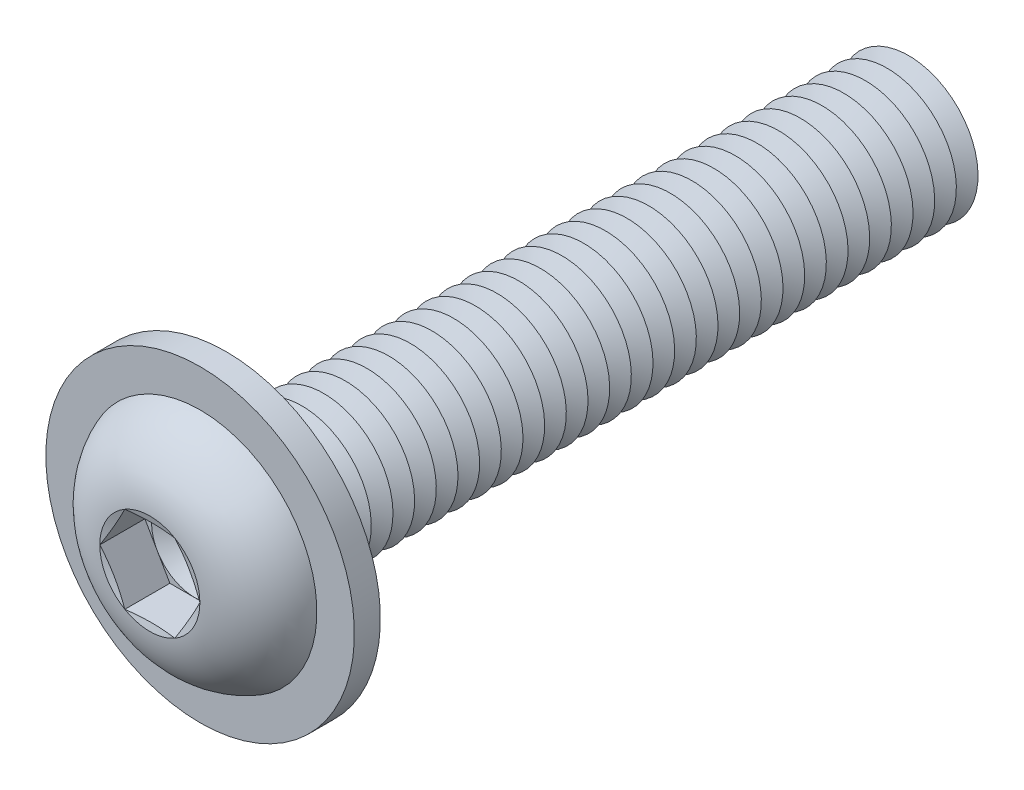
ISO-10303-21;
HEADER;
FILE_DESCRIPTION(('STEP AP214'),'2;1');
FILE_NAME('part.step','',(''),(''),'','','');
FILE_SCHEMA(('AUTOMOTIVE_DESIGN { 1 0 10303 214 1 1 1 1 }'));
ENDSEC;
DATA;
#1=APPLICATION_CONTEXT('core data for automotive mechanical design processes');
#2=APPLICATION_PROTOCOL_DEFINITION('international standard','automotive_design',2000,#1);
#3=PRODUCT_CONTEXT('',#1,'mechanical');
#4=PRODUCT('Part','Part','',(#3));
#5=PRODUCT_RELATED_PRODUCT_CATEGORY('part','',(#4));
#6=PRODUCT_DEFINITION_FORMATION('','',#4);
#7=PRODUCT_DEFINITION_CONTEXT('part definition',#1,'design');
#8=PRODUCT_DEFINITION('design','',#6,#7);
#9=PRODUCT_DEFINITION_SHAPE('','',#8);
#10=(LENGTH_UNIT() NAMED_UNIT(*) SI_UNIT(.MILLI.,.METRE.));
#11=(NAMED_UNIT(*) PLANE_ANGLE_UNIT() SI_UNIT($,.RADIAN.));
#12=(NAMED_UNIT(*) SI_UNIT($,.STERADIAN.) SOLID_ANGLE_UNIT());
#13=UNCERTAINTY_MEASURE_WITH_UNIT(LENGTH_MEASURE(1.E-05),#10,'distance_accuracy_value','');
#14=(GEOMETRIC_REPRESENTATION_CONTEXT(3) GLOBAL_UNCERTAINTY_ASSIGNED_CONTEXT((#13)) GLOBAL_UNIT_ASSIGNED_CONTEXT((#10,
#11,#12)) REPRESENTATION_CONTEXT('',''));
#15=CARTESIAN_POINT('',(0.,0.,0.));
#16=DIRECTION('',(0.,0.,1.));
#17=DIRECTION('',(1.,0.,0.));
#18=AXIS2_PLACEMENT_3D('',#15,#16,#17);
#19=CARTESIAN_POINT('',(0.,0.,-35.625));
#20=DIRECTION('',(0.,0.,1.));
#21=DIRECTION('',(0.,-1.,0.));
#22=AXIS2_PLACEMENT_3D('',#19,#20,#21);
#23=CONICAL_SURFACE('',#22,3.99999999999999,1.0471975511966);
#24=CARTESIAN_POINT('',(0.,0.,-36.25));
#25=DIRECTION('',(0.,0.,1.));
#26=DIRECTION('',(0.,-1.,0.));
#27=AXIS2_PLACEMENT_3D('',#24,#25,#26);
#28=CIRCLE('',#27,2.91746824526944);
#29=CARTESIAN_POINT('',(0.,-2.91746824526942,-36.25));
#30=VERTEX_POINT('',#29);
#31=EDGE_CURVE('E465',#30,#30,#28,.T.);
#32=ORIENTED_EDGE('',*,*,#31,.T.);
#33=EDGE_LOOP('',(#32));
#34=FACE_BOUND('',#33,.T.);
#35=CARTESIAN_POINT('',(0.,0.,-35.625));
#36=DIRECTION('',(0.,0.,1.));
#37=DIRECTION('',(0.,-1.,0.));
#38=AXIS2_PLACEMENT_3D('',#35,#36,#37);
#39=CIRCLE('',#38,3.99999999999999);
#40=CARTESIAN_POINT('',(0.,-3.99999999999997,-35.625));
#41=VERTEX_POINT('',#40);
#42=EDGE_CURVE('E461',#41,#41,#39,.T.);
#43=ORIENTED_EDGE('',*,*,#42,.F.);
#44=EDGE_LOOP('',(#43));
#45=FACE_BOUND('',#44,.T.);
#46=ADVANCED_FACE('F39',(#34,#45),#23,.T.);
#47=CARTESIAN_POINT('',(0.,0.,-36.25));
#48=DIRECTION('',(0.,0.,-1.));
#49=DIRECTION('',(0.,1.,0.));
#50=AXIS2_PLACEMENT_3D('',#47,#48,#49);
#51=CONICAL_SURFACE('',#50,2.91746824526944,1.0471975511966);
#52=CARTESIAN_POINT('',(0.,0.,-36.875));
#53=DIRECTION('',(0.,0.,1.));
#54=DIRECTION('',(0.,-1.,0.));
#55=AXIS2_PLACEMENT_3D('',#52,#53,#54);
#56=CIRCLE('',#55,3.99999999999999);
#57=CARTESIAN_POINT('',(0.,-3.99999999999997,-36.875));
#58=VERTEX_POINT('',#57);
#59=EDGE_CURVE('E469',#58,#58,#56,.T.);
#60=ORIENTED_EDGE('',*,*,#59,.T.);
#61=EDGE_LOOP('',(#60));
#62=FACE_BOUND('',#61,.T.);
#63=ORIENTED_EDGE('',*,*,#31,.F.);
#64=EDGE_LOOP('',(#63));
#65=FACE_BOUND('',#64,.T.);
#66=ADVANCED_FACE('F584',(#62,#65),#51,.T.);
#67=CARTESIAN_POINT('',(0.,4.,-40.));
#68=DIRECTION('',(0.,0.,-1.));
#69=DIRECTION('',(0.,1.,0.));
#70=AXIS2_PLACEMENT_3D('',#67,#68,#69);
#71=PLANE('',#70);
#72=CARTESIAN_POINT('',(0.,0.,-40.));
#73=DIRECTION('',(0.,0.,1.));
#74=DIRECTION('',(0.,-1.,0.));
#75=AXIS2_PLACEMENT_3D('',#72,#73,#74);
#76=CIRCLE('',#75,2.91746824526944);
#77=CARTESIAN_POINT('',(0.,-2.91746824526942,-40.));
#78=VERTEX_POINT('',#77);
#79=EDGE_CURVE('E489',#78,#78,#76,.T.);
#80=ORIENTED_EDGE('',*,*,#79,.F.);
#81=EDGE_LOOP('',(#80));
#82=FACE_BOUND('',#81,.T.);
#83=ADVANCED_FACE('F590',(#82),#71,.T.);
#84=CARTESIAN_POINT('',(0.,0.,-39.375));
#85=DIRECTION('',(0.,0.,1.));
#86=DIRECTION('',(0.,-1.,0.));
#87=AXIS2_PLACEMENT_3D('',#84,#85,#86);
#88=CONICAL_SURFACE('',#87,3.99999999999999,1.0471975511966);
#89=ORIENTED_EDGE('',*,*,#79,.T.);
#90=EDGE_LOOP('',(#89));
#91=FACE_BOUND('',#90,.T.);
#92=CARTESIAN_POINT('',(0.,0.,-39.375));
#93=DIRECTION('',(0.,0.,1.));
#94=DIRECTION('',(0.,-1.,0.));
#95=AXIS2_PLACEMENT_3D('',#92,#93,#94);
#96=CIRCLE('',#95,3.99999999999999);
#97=CARTESIAN_POINT('',(0.,-3.99999999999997,-39.375));
#98=VERTEX_POINT('',#97);
#99=EDGE_CURVE('E485',#98,#98,#96,.T.);
#100=ORIENTED_EDGE('',*,*,#99,.F.);
#101=EDGE_LOOP('',(#100));
#102=FACE_BOUND('',#101,.T.);
#103=ADVANCED_FACE('F609',(#91,#102),#88,.T.);
#104=CARTESIAN_POINT('',(0.,0.,-38.75));
#105=DIRECTION('',(0.,0.,-1.));
#106=DIRECTION('',(0.,1.,0.));
#107=AXIS2_PLACEMENT_3D('',#104,#105,#106);
#108=CONICAL_SURFACE('',#107,2.91746824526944,1.0471975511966);
#109=ORIENTED_EDGE('',*,*,#99,.T.);
#110=EDGE_LOOP('',(#109));
#111=FACE_BOUND('',#110,.T.);
#112=CARTESIAN_POINT('',(0.,0.,-38.75));
#113=DIRECTION('',(0.,0.,1.));
#114=DIRECTION('',(0.,-1.,0.));
#115=AXIS2_PLACEMENT_3D('',#112,#113,#114);
#116=CIRCLE('',#115,2.91746824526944);
#117=CARTESIAN_POINT('',(0.,-2.91746824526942,-38.75));
#118=VERTEX_POINT('',#117);
#119=EDGE_CURVE('E481',#118,#118,#116,.T.);
#120=ORIENTED_EDGE('',*,*,#119,.F.);
#121=EDGE_LOOP('',(#120));
#122=FACE_BOUND('',#121,.T.);
#123=ADVANCED_FACE('F606',(#111,#122),#108,.T.);
#124=CARTESIAN_POINT('',(0.,0.,-38.125));
#125=DIRECTION('',(0.,0.,1.));
#126=DIRECTION('',(0.,-1.,0.));
#127=AXIS2_PLACEMENT_3D('',#124,#125,#126);
#128=CONICAL_SURFACE('',#127,3.99999999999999,1.0471975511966);
#129=ORIENTED_EDGE('',*,*,#119,.T.);
#130=EDGE_LOOP('',(#129));
#131=FACE_BOUND('',#130,.T.);
#132=CARTESIAN_POINT('',(0.,0.,-38.125));
#133=DIRECTION('',(0.,0.,1.));
#134=DIRECTION('',(0.,-1.,0.));
#135=AXIS2_PLACEMENT_3D('',#132,#133,#134);
#136=CIRCLE('',#135,3.99999999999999);
#137=CARTESIAN_POINT('',(0.,-3.99999999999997,-38.125));
#138=VERTEX_POINT('',#137);
#139=EDGE_CURVE('E477',#138,#138,#136,.T.);
#140=ORIENTED_EDGE('',*,*,#139,.F.);
#141=EDGE_LOOP('',(#140));
#142=FACE_BOUND('',#141,.T.);
#143=ADVANCED_FACE('F600',(#131,#142),#128,.T.);
#144=CARTESIAN_POINT('',(0.,0.,-37.5));
#145=DIRECTION('',(0.,0.,-1.));
#146=DIRECTION('',(0.,1.,0.));
#147=AXIS2_PLACEMENT_3D('',#144,#145,#146);
#148=CONICAL_SURFACE('',#147,2.91746824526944,1.0471975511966);
#149=ORIENTED_EDGE('',*,*,#139,.T.);
#150=EDGE_LOOP('',(#149));
#151=FACE_BOUND('',#150,.T.);
#152=CARTESIAN_POINT('',(0.,0.,-37.5));
#153=DIRECTION('',(0.,0.,1.));
#154=DIRECTION('',(0.,-1.,0.));
#155=AXIS2_PLACEMENT_3D('',#152,#153,#154);
#156=CIRCLE('',#155,2.91746824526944);
#157=CARTESIAN_POINT('',(0.,-2.91746824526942,-37.5));
#158=VERTEX_POINT('',#157);
#159=EDGE_CURVE('E473',#158,#158,#156,.T.);
#160=ORIENTED_EDGE('',*,*,#159,.F.);
#161=EDGE_LOOP('',(#160));
#162=FACE_BOUND('',#161,.T.);
#163=ADVANCED_FACE('F596',(#151,#162),#148,.T.);
#164=CARTESIAN_POINT('',(0.,0.,-36.875));
#165=DIRECTION('',(0.,0.,1.));
#166=DIRECTION('',(0.,-1.,0.));
#167=AXIS2_PLACEMENT_3D('',#164,#165,#166);
#168=CONICAL_SURFACE('',#167,3.99999999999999,1.0471975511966);
#169=ORIENTED_EDGE('',*,*,#159,.T.);
#170=EDGE_LOOP('',(#169));
#171=FACE_BOUND('',#170,.T.);
#172=ORIENTED_EDGE('',*,*,#59,.F.);
#173=EDGE_LOOP('',(#172));
#174=FACE_BOUND('',#173,.T.);
#175=ADVANCED_FACE('F599',(#171,#174),#168,.T.);
#176=CARTESIAN_POINT('',(0.,0.,-34.375));
#177=DIRECTION('',(0.,0.,1.));
#178=DIRECTION('',(0.,-1.,0.));
#179=AXIS2_PLACEMENT_3D('',#176,#177,#178);
#180=CONICAL_SURFACE('',#179,3.99999999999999,1.0471975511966);
#181=CARTESIAN_POINT('',(0.,0.,-35.));
#182=DIRECTION('',(0.,0.,1.));
#183=DIRECTION('',(0.,-1.,0.));
#184=AXIS2_PLACEMENT_3D('',#181,#182,#183);
#185=CIRCLE('',#184,2.91746824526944);
#186=CARTESIAN_POINT('',(0.,-2.91746824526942,-35.));
#187=VERTEX_POINT('',#186);
#188=EDGE_CURVE('E457',#187,#187,#185,.T.);
#189=ORIENTED_EDGE('',*,*,#188,.T.);
#190=EDGE_LOOP('',(#189));
#191=FACE_BOUND('',#190,.T.);
#192=CARTESIAN_POINT('',(0.,0.,-34.375));
#193=DIRECTION('',(0.,0.,1.));
#194=DIRECTION('',(0.,-1.,0.));
#195=AXIS2_PLACEMENT_3D('',#192,#193,#194);
#196=CIRCLE('',#195,3.99999999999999);
#197=CARTESIAN_POINT('',(0.,-3.99999999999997,-34.375));
#198=VERTEX_POINT('',#197);
#199=EDGE_CURVE('E453',#198,#198,#196,.T.);
#200=ORIENTED_EDGE('',*,*,#199,.F.);
#201=EDGE_LOOP('',(#200));
#202=FACE_BOUND('',#201,.T.);
#203=ADVANCED_FACE('F604',(#191,#202),#180,.T.);
#204=CARTESIAN_POINT('',(0.,0.,-35.));
#205=DIRECTION('',(0.,0.,-1.));
#206=DIRECTION('',(0.,1.,0.));
#207=AXIS2_PLACEMENT_3D('',#204,#205,#206);
#208=CONICAL_SURFACE('',#207,2.91746824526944,1.0471975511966);
#209=ORIENTED_EDGE('',*,*,#42,.T.);
#210=EDGE_LOOP('',(#209));
#211=FACE_BOUND('',#210,.T.);
#212=ORIENTED_EDGE('',*,*,#188,.F.);
#213=EDGE_LOOP('',(#212));
#214=FACE_BOUND('',#213,.T.);
#215=ADVANCED_FACE('F655',(#211,#214),#208,.T.);
#216=CARTESIAN_POINT('',(0.,0.,-33.125));
#217=DIRECTION('',(0.,0.,1.));
#218=DIRECTION('',(0.,-1.,0.));
#219=AXIS2_PLACEMENT_3D('',#216,#217,#218);
#220=CONICAL_SURFACE('',#219,3.99999999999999,1.0471975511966);
#221=CARTESIAN_POINT('',(0.,0.,-33.75));
#222=DIRECTION('',(0.,0.,1.));
#223=DIRECTION('',(0.,-1.,0.));
#224=AXIS2_PLACEMENT_3D('',#221,#222,#223);
#225=CIRCLE('',#224,2.91746824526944);
#226=CARTESIAN_POINT('',(0.,-2.91746824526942,-33.75));
#227=VERTEX_POINT('',#226);
#228=EDGE_CURVE('E449',#227,#227,#225,.T.);
#229=ORIENTED_EDGE('',*,*,#228,.T.);
#230=EDGE_LOOP('',(#229));
#231=FACE_BOUND('',#230,.T.);
#232=CARTESIAN_POINT('',(0.,0.,-33.125));
#233=DIRECTION('',(0.,0.,1.));
#234=DIRECTION('',(0.,-1.,0.));
#235=AXIS2_PLACEMENT_3D('',#232,#233,#234);
#236=CIRCLE('',#235,3.99999999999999);
#237=CARTESIAN_POINT('',(0.,-3.99999999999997,-33.125));
#238=VERTEX_POINT('',#237);
#239=EDGE_CURVE('E445',#238,#238,#236,.T.);
#240=ORIENTED_EDGE('',*,*,#239,.F.);
#241=EDGE_LOOP('',(#240));
#242=FACE_BOUND('',#241,.T.);
#243=ADVANCED_FACE('F661',(#231,#242),#220,.T.);
#244=CARTESIAN_POINT('',(0.,0.,-33.75));
#245=DIRECTION('',(0.,0.,-1.));
#246=DIRECTION('',(0.,1.,0.));
#247=AXIS2_PLACEMENT_3D('',#244,#245,#246);
#248=CONICAL_SURFACE('',#247,2.91746824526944,1.0471975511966);
#249=ORIENTED_EDGE('',*,*,#199,.T.);
#250=EDGE_LOOP('',(#249));
#251=FACE_BOUND('',#250,.T.);
#252=ORIENTED_EDGE('',*,*,#228,.F.);
#253=EDGE_LOOP('',(#252));
#254=FACE_BOUND('',#253,.T.);
#255=ADVANCED_FACE('F668',(#251,#254),#248,.T.);
#256=CARTESIAN_POINT('',(0.,0.,-31.875));
#257=DIRECTION('',(0.,0.,1.));
#258=DIRECTION('',(0.,-1.,0.));
#259=AXIS2_PLACEMENT_3D('',#256,#257,#258);
#260=CONICAL_SURFACE('',#259,3.99999999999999,1.0471975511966);
#261=CARTESIAN_POINT('',(0.,0.,-32.5));
#262=DIRECTION('',(0.,0.,1.));
#263=DIRECTION('',(0.,-1.,0.));
#264=AXIS2_PLACEMENT_3D('',#261,#262,#263);
#265=CIRCLE('',#264,2.91746824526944);
#266=CARTESIAN_POINT('',(0.,-2.91746824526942,-32.5));
#267=VERTEX_POINT('',#266);
#268=EDGE_CURVE('E441',#267,#267,#265,.T.);
#269=ORIENTED_EDGE('',*,*,#268,.T.);
#270=EDGE_LOOP('',(#269));
#271=FACE_BOUND('',#270,.T.);
#272=CARTESIAN_POINT('',(0.,0.,-31.875));
#273=DIRECTION('',(0.,0.,1.));
#274=DIRECTION('',(0.,-1.,0.));
#275=AXIS2_PLACEMENT_3D('',#272,#273,#274);
#276=CIRCLE('',#275,3.99999999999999);
#277=CARTESIAN_POINT('',(0.,-3.99999999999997,-31.875));
#278=VERTEX_POINT('',#277);
#279=EDGE_CURVE('E437',#278,#278,#276,.T.);
#280=ORIENTED_EDGE('',*,*,#279,.F.);
#281=EDGE_LOOP('',(#280));
#282=FACE_BOUND('',#281,.T.);
#283=ADVANCED_FACE('F675',(#271,#282),#260,.T.);
#284=CARTESIAN_POINT('',(0.,0.,-32.5));
#285=DIRECTION('',(0.,0.,-1.));
#286=DIRECTION('',(0.,1.,0.));
#287=AXIS2_PLACEMENT_3D('',#284,#285,#286);
#288=CONICAL_SURFACE('',#287,2.91746824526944,1.0471975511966);
#289=ORIENTED_EDGE('',*,*,#239,.T.);
#290=EDGE_LOOP('',(#289));
#291=FACE_BOUND('',#290,.T.);
#292=ORIENTED_EDGE('',*,*,#268,.F.);
#293=EDGE_LOOP('',(#292));
#294=FACE_BOUND('',#293,.T.);
#295=ADVANCED_FACE('F682',(#291,#294),#288,.T.);
#296=CARTESIAN_POINT('',(0.,0.,-30.625));
#297=DIRECTION('',(0.,0.,1.));
#298=DIRECTION('',(0.,-1.,0.));
#299=AXIS2_PLACEMENT_3D('',#296,#297,#298);
#300=CONICAL_SURFACE('',#299,3.99999999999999,1.0471975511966);
#301=CARTESIAN_POINT('',(0.,0.,-31.25));
#302=DIRECTION('',(0.,0.,1.));
#303=DIRECTION('',(0.,-1.,0.));
#304=AXIS2_PLACEMENT_3D('',#301,#302,#303);
#305=CIRCLE('',#304,2.91746824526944);
#306=CARTESIAN_POINT('',(0.,-2.91746824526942,-31.25));
#307=VERTEX_POINT('',#306);
#308=EDGE_CURVE('E433',#307,#307,#305,.T.);
#309=ORIENTED_EDGE('',*,*,#308,.T.);
#310=EDGE_LOOP('',(#309));
#311=FACE_BOUND('',#310,.T.);
#312=CARTESIAN_POINT('',(0.,0.,-30.625));
#313=DIRECTION('',(0.,0.,1.));
#314=DIRECTION('',(0.,-1.,0.));
#315=AXIS2_PLACEMENT_3D('',#312,#313,#314);
#316=CIRCLE('',#315,3.99999999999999);
#317=CARTESIAN_POINT('',(0.,-3.99999999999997,-30.625));
#318=VERTEX_POINT('',#317);
#319=EDGE_CURVE('E429',#318,#318,#316,.T.);
#320=ORIENTED_EDGE('',*,*,#319,.F.);
#321=EDGE_LOOP('',(#320));
#322=FACE_BOUND('',#321,.T.);
#323=ADVANCED_FACE('F689',(#311,#322),#300,.T.);
#324=CARTESIAN_POINT('',(0.,0.,-31.25));
#325=DIRECTION('',(0.,0.,-1.));
#326=DIRECTION('',(0.,1.,0.));
#327=AXIS2_PLACEMENT_3D('',#324,#325,#326);
#328=CONICAL_SURFACE('',#327,2.91746824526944,1.0471975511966);
#329=ORIENTED_EDGE('',*,*,#279,.T.);
#330=EDGE_LOOP('',(#329));
#331=FACE_BOUND('',#330,.T.);
#332=ORIENTED_EDGE('',*,*,#308,.F.);
#333=EDGE_LOOP('',(#332));
#334=FACE_BOUND('',#333,.T.);
#335=ADVANCED_FACE('F696',(#331,#334),#328,.T.);
#336=CARTESIAN_POINT('',(0.,0.,-29.375));
#337=DIRECTION('',(0.,0.,1.));
#338=DIRECTION('',(0.,-1.,0.));
#339=AXIS2_PLACEMENT_3D('',#336,#337,#338);
#340=CONICAL_SURFACE('',#339,3.99999999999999,1.0471975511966);
#341=CARTESIAN_POINT('',(0.,0.,-30.));
#342=DIRECTION('',(0.,0.,1.));
#343=DIRECTION('',(0.,-1.,0.));
#344=AXIS2_PLACEMENT_3D('',#341,#342,#343);
#345=CIRCLE('',#344,2.91746824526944);
#346=CARTESIAN_POINT('',(0.,-2.91746824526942,-30.));
#347=VERTEX_POINT('',#346);
#348=EDGE_CURVE('E425',#347,#347,#345,.T.);
#349=ORIENTED_EDGE('',*,*,#348,.T.);
#350=EDGE_LOOP('',(#349));
#351=FACE_BOUND('',#350,.T.);
#352=CARTESIAN_POINT('',(0.,0.,-29.375));
#353=DIRECTION('',(0.,0.,1.));
#354=DIRECTION('',(0.,-1.,0.));
#355=AXIS2_PLACEMENT_3D('',#352,#353,#354);
#356=CIRCLE('',#355,3.99999999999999);
#357=CARTESIAN_POINT('',(0.,-3.99999999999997,-29.375));
#358=VERTEX_POINT('',#357);
#359=EDGE_CURVE('E421',#358,#358,#356,.T.);
#360=ORIENTED_EDGE('',*,*,#359,.F.);
#361=EDGE_LOOP('',(#360));
#362=FACE_BOUND('',#361,.T.);
#363=ADVANCED_FACE('F703',(#351,#362),#340,.T.);
#364=CARTESIAN_POINT('',(0.,0.,-30.));
#365=DIRECTION('',(0.,0.,-1.));
#366=DIRECTION('',(0.,1.,0.));
#367=AXIS2_PLACEMENT_3D('',#364,#365,#366);
#368=CONICAL_SURFACE('',#367,2.91746824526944,1.0471975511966);
#369=ORIENTED_EDGE('',*,*,#319,.T.);
#370=EDGE_LOOP('',(#369));
#371=FACE_BOUND('',#370,.T.);
#372=ORIENTED_EDGE('',*,*,#348,.F.);
#373=EDGE_LOOP('',(#372));
#374=FACE_BOUND('',#373,.T.);
#375=ADVANCED_FACE('F710',(#371,#374),#368,.T.);
#376=CARTESIAN_POINT('',(0.,0.,-28.125));
#377=DIRECTION('',(0.,0.,1.));
#378=DIRECTION('',(0.,-1.,0.));
#379=AXIS2_PLACEMENT_3D('',#376,#377,#378);
#380=CONICAL_SURFACE('',#379,3.99999999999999,1.0471975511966);
#381=CARTESIAN_POINT('',(0.,0.,-28.75));
#382=DIRECTION('',(0.,0.,1.));
#383=DIRECTION('',(0.,-1.,0.));
#384=AXIS2_PLACEMENT_3D('',#381,#382,#383);
#385=CIRCLE('',#384,2.91746824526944);
#386=CARTESIAN_POINT('',(0.,-2.91746824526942,-28.75));
#387=VERTEX_POINT('',#386);
#388=EDGE_CURVE('E417',#387,#387,#385,.T.);
#389=ORIENTED_EDGE('',*,*,#388,.T.);
#390=EDGE_LOOP('',(#389));
#391=FACE_BOUND('',#390,.T.);
#392=CARTESIAN_POINT('',(0.,0.,-28.125));
#393=DIRECTION('',(0.,0.,1.));
#394=DIRECTION('',(0.,-1.,0.));
#395=AXIS2_PLACEMENT_3D('',#392,#393,#394);
#396=CIRCLE('',#395,3.99999999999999);
#397=CARTESIAN_POINT('',(0.,-3.99999999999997,-28.125));
#398=VERTEX_POINT('',#397);
#399=EDGE_CURVE('E413',#398,#398,#396,.T.);
#400=ORIENTED_EDGE('',*,*,#399,.F.);
#401=EDGE_LOOP('',(#400));
#402=FACE_BOUND('',#401,.T.);
#403=ADVANCED_FACE('F717',(#391,#402),#380,.T.);
#404=CARTESIAN_POINT('',(0.,0.,-28.75));
#405=DIRECTION('',(0.,0.,-1.));
#406=DIRECTION('',(0.,1.,0.));
#407=AXIS2_PLACEMENT_3D('',#404,#405,#406);
#408=CONICAL_SURFACE('',#407,2.91746824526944,1.0471975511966);
#409=ORIENTED_EDGE('',*,*,#359,.T.);
#410=EDGE_LOOP('',(#409));
#411=FACE_BOUND('',#410,.T.);
#412=ORIENTED_EDGE('',*,*,#388,.F.);
#413=EDGE_LOOP('',(#412));
#414=FACE_BOUND('',#413,.T.);
#415=ADVANCED_FACE('F724',(#411,#414),#408,.T.);
#416=CARTESIAN_POINT('',(0.,0.,-26.875));
#417=DIRECTION('',(0.,0.,1.));
#418=DIRECTION('',(0.,-1.,0.));
#419=AXIS2_PLACEMENT_3D('',#416,#417,#418);
#420=CONICAL_SURFACE('',#419,3.99999999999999,1.0471975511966);
#421=CARTESIAN_POINT('',(0.,0.,-27.5));
#422=DIRECTION('',(0.,0.,1.));
#423=DIRECTION('',(0.,-1.,0.));
#424=AXIS2_PLACEMENT_3D('',#421,#422,#423);
#425=CIRCLE('',#424,2.91746824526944);
#426=CARTESIAN_POINT('',(0.,-2.91746824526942,-27.5));
#427=VERTEX_POINT('',#426);
#428=EDGE_CURVE('E409',#427,#427,#425,.T.);
#429=ORIENTED_EDGE('',*,*,#428,.T.);
#430=EDGE_LOOP('',(#429));
#431=FACE_BOUND('',#430,.T.);
#432=CARTESIAN_POINT('',(0.,0.,-26.875));
#433=DIRECTION('',(0.,0.,1.));
#434=DIRECTION('',(0.,-1.,0.));
#435=AXIS2_PLACEMENT_3D('',#432,#433,#434);
#436=CIRCLE('',#435,3.99999999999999);
#437=CARTESIAN_POINT('',(0.,-3.99999999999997,-26.875));
#438=VERTEX_POINT('',#437);
#439=EDGE_CURVE('E405',#438,#438,#436,.T.);
#440=ORIENTED_EDGE('',*,*,#439,.F.);
#441=EDGE_LOOP('',(#440));
#442=FACE_BOUND('',#441,.T.);
#443=ADVANCED_FACE('F731',(#431,#442),#420,.T.);
#444=CARTESIAN_POINT('',(0.,0.,-27.5));
#445=DIRECTION('',(0.,0.,-1.));
#446=DIRECTION('',(0.,1.,0.));
#447=AXIS2_PLACEMENT_3D('',#444,#445,#446);
#448=CONICAL_SURFACE('',#447,2.91746824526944,1.0471975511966);
#449=ORIENTED_EDGE('',*,*,#399,.T.);
#450=EDGE_LOOP('',(#449));
#451=FACE_BOUND('',#450,.T.);
#452=ORIENTED_EDGE('',*,*,#428,.F.);
#453=EDGE_LOOP('',(#452));
#454=FACE_BOUND('',#453,.T.);
#455=ADVANCED_FACE('F738',(#451,#454),#448,.T.);
#456=CARTESIAN_POINT('',(0.,0.,-25.625));
#457=DIRECTION('',(0.,0.,1.));
#458=DIRECTION('',(0.,-1.,0.));
#459=AXIS2_PLACEMENT_3D('',#456,#457,#458);
#460=CONICAL_SURFACE('',#459,3.99999999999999,1.0471975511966);
#461=CARTESIAN_POINT('',(0.,0.,-26.25));
#462=DIRECTION('',(0.,0.,1.));
#463=DIRECTION('',(0.,-1.,0.));
#464=AXIS2_PLACEMENT_3D('',#461,#462,#463);
#465=CIRCLE('',#464,2.91746824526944);
#466=CARTESIAN_POINT('',(0.,-2.91746824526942,-26.25));
#467=VERTEX_POINT('',#466);
#468=EDGE_CURVE('E401',#467,#467,#465,.T.);
#469=ORIENTED_EDGE('',*,*,#468,.T.);
#470=EDGE_LOOP('',(#469));
#471=FACE_BOUND('',#470,.T.);
#472=CARTESIAN_POINT('',(0.,0.,-25.625));
#473=DIRECTION('',(0.,0.,1.));
#474=DIRECTION('',(0.,-1.,0.));
#475=AXIS2_PLACEMENT_3D('',#472,#473,#474);
#476=CIRCLE('',#475,3.99999999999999);
#477=CARTESIAN_POINT('',(0.,-3.99999999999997,-25.625));
#478=VERTEX_POINT('',#477);
#479=EDGE_CURVE('E397',#478,#478,#476,.T.);
#480=ORIENTED_EDGE('',*,*,#479,.F.);
#481=EDGE_LOOP('',(#480));
#482=FACE_BOUND('',#481,.T.);
#483=ADVANCED_FACE('F745',(#471,#482),#460,.T.);
#484=CARTESIAN_POINT('',(0.,0.,-26.25));
#485=DIRECTION('',(0.,0.,-1.));
#486=DIRECTION('',(0.,1.,0.));
#487=AXIS2_PLACEMENT_3D('',#484,#485,#486);
#488=CONICAL_SURFACE('',#487,2.91746824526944,1.0471975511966);
#489=ORIENTED_EDGE('',*,*,#439,.T.);
#490=EDGE_LOOP('',(#489));
#491=FACE_BOUND('',#490,.T.);
#492=ORIENTED_EDGE('',*,*,#468,.F.);
#493=EDGE_LOOP('',(#492));
#494=FACE_BOUND('',#493,.T.);
#495=ADVANCED_FACE('F752',(#491,#494),#488,.T.);
#496=CARTESIAN_POINT('',(0.,0.,-24.375));
#497=DIRECTION('',(0.,0.,1.));
#498=DIRECTION('',(0.,-1.,0.));
#499=AXIS2_PLACEMENT_3D('',#496,#497,#498);
#500=CONICAL_SURFACE('',#499,3.99999999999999,1.0471975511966);
#501=CARTESIAN_POINT('',(0.,0.,-25.));
#502=DIRECTION('',(0.,0.,1.));
#503=DIRECTION('',(0.,-1.,0.));
#504=AXIS2_PLACEMENT_3D('',#501,#502,#503);
#505=CIRCLE('',#504,2.91746824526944);
#506=CARTESIAN_POINT('',(0.,-2.91746824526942,-25.));
#507=VERTEX_POINT('',#506);
#508=EDGE_CURVE('E393',#507,#507,#505,.T.);
#509=ORIENTED_EDGE('',*,*,#508,.T.);
#510=EDGE_LOOP('',(#509));
#511=FACE_BOUND('',#510,.T.);
#512=CARTESIAN_POINT('',(0.,0.,-24.375));
#513=DIRECTION('',(0.,0.,1.));
#514=DIRECTION('',(0.,-1.,0.));
#515=AXIS2_PLACEMENT_3D('',#512,#513,#514);
#516=CIRCLE('',#515,3.99999999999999);
#517=CARTESIAN_POINT('',(0.,-3.99999999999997,-24.375));
#518=VERTEX_POINT('',#517);
#519=EDGE_CURVE('E389',#518,#518,#516,.T.);
#520=ORIENTED_EDGE('',*,*,#519,.F.);
#521=EDGE_LOOP('',(#520));
#522=FACE_BOUND('',#521,.T.);
#523=ADVANCED_FACE('F759',(#511,#522),#500,.T.);
#524=CARTESIAN_POINT('',(0.,0.,-25.));
#525=DIRECTION('',(0.,0.,-1.));
#526=DIRECTION('',(0.,1.,0.));
#527=AXIS2_PLACEMENT_3D('',#524,#525,#526);
#528=CONICAL_SURFACE('',#527,2.91746824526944,1.0471975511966);
#529=ORIENTED_EDGE('',*,*,#479,.T.);
#530=EDGE_LOOP('',(#529));
#531=FACE_BOUND('',#530,.T.);
#532=ORIENTED_EDGE('',*,*,#508,.F.);
#533=EDGE_LOOP('',(#532));
#534=FACE_BOUND('',#533,.T.);
#535=ADVANCED_FACE('F766',(#531,#534),#528,.T.);
#536=CARTESIAN_POINT('',(0.,0.,-23.125));
#537=DIRECTION('',(0.,0.,1.));
#538=DIRECTION('',(0.,-1.,0.));
#539=AXIS2_PLACEMENT_3D('',#536,#537,#538);
#540=CONICAL_SURFACE('',#539,3.99999999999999,1.0471975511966);
#541=CARTESIAN_POINT('',(0.,0.,-23.75));
#542=DIRECTION('',(0.,0.,1.));
#543=DIRECTION('',(0.,-1.,0.));
#544=AXIS2_PLACEMENT_3D('',#541,#542,#543);
#545=CIRCLE('',#544,2.91746824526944);
#546=CARTESIAN_POINT('',(0.,-2.91746824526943,-23.75));
#547=VERTEX_POINT('',#546);
#548=EDGE_CURVE('E385',#547,#547,#545,.T.);
#549=ORIENTED_EDGE('',*,*,#548,.T.);
#550=EDGE_LOOP('',(#549));
#551=FACE_BOUND('',#550,.T.);
#552=CARTESIAN_POINT('',(0.,0.,-23.125));
#553=DIRECTION('',(0.,0.,1.));
#554=DIRECTION('',(0.,-1.,0.));
#555=AXIS2_PLACEMENT_3D('',#552,#553,#554);
#556=CIRCLE('',#555,3.99999999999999);
#557=CARTESIAN_POINT('',(0.,-3.99999999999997,-23.125));
#558=VERTEX_POINT('',#557);
#559=EDGE_CURVE('E381',#558,#558,#556,.T.);
#560=ORIENTED_EDGE('',*,*,#559,.F.);
#561=EDGE_LOOP('',(#560));
#562=FACE_BOUND('',#561,.T.);
#563=ADVANCED_FACE('F773',(#551,#562),#540,.T.);
#564=CARTESIAN_POINT('',(0.,0.,-23.75));
#565=DIRECTION('',(0.,0.,-1.));
#566=DIRECTION('',(0.,1.,0.));
#567=AXIS2_PLACEMENT_3D('',#564,#565,#566);
#568=CONICAL_SURFACE('',#567,2.91746824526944,1.0471975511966);
#569=ORIENTED_EDGE('',*,*,#519,.T.);
#570=EDGE_LOOP('',(#569));
#571=FACE_BOUND('',#570,.T.);
#572=ORIENTED_EDGE('',*,*,#548,.F.);
#573=EDGE_LOOP('',(#572));
#574=FACE_BOUND('',#573,.T.);
#575=ADVANCED_FACE('F780',(#571,#574),#568,.T.);
#576=CARTESIAN_POINT('',(0.,0.,-21.875));
#577=DIRECTION('',(0.,0.,1.));
#578=DIRECTION('',(0.,-1.,0.));
#579=AXIS2_PLACEMENT_3D('',#576,#577,#578);
#580=CONICAL_SURFACE('',#579,3.99999999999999,1.0471975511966);
#581=CARTESIAN_POINT('',(0.,0.,-22.5));
#582=DIRECTION('',(0.,0.,1.));
#583=DIRECTION('',(0.,-1.,0.));
#584=AXIS2_PLACEMENT_3D('',#581,#582,#583);
#585=CIRCLE('',#584,2.91746824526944);
#586=CARTESIAN_POINT('',(0.,-2.91746824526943,-22.5));
#587=VERTEX_POINT('',#586);
#588=EDGE_CURVE('E377',#587,#587,#585,.T.);
#589=ORIENTED_EDGE('',*,*,#588,.T.);
#590=EDGE_LOOP('',(#589));
#591=FACE_BOUND('',#590,.T.);
#592=CARTESIAN_POINT('',(0.,0.,-21.875));
#593=DIRECTION('',(0.,0.,1.));
#594=DIRECTION('',(0.,-1.,0.));
#595=AXIS2_PLACEMENT_3D('',#592,#593,#594);
#596=CIRCLE('',#595,3.99999999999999);
#597=CARTESIAN_POINT('',(0.,-3.99999999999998,-21.875));
#598=VERTEX_POINT('',#597);
#599=EDGE_CURVE('E373',#598,#598,#596,.T.);
#600=ORIENTED_EDGE('',*,*,#599,.F.);
#601=EDGE_LOOP('',(#600));
#602=FACE_BOUND('',#601,.T.);
#603=ADVANCED_FACE('F787',(#591,#602),#580,.T.);
#604=CARTESIAN_POINT('',(0.,0.,-22.5));
#605=DIRECTION('',(0.,0.,-1.));
#606=DIRECTION('',(0.,1.,0.));
#607=AXIS2_PLACEMENT_3D('',#604,#605,#606);
#608=CONICAL_SURFACE('',#607,2.91746824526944,1.0471975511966);
#609=ORIENTED_EDGE('',*,*,#559,.T.);
#610=EDGE_LOOP('',(#609));
#611=FACE_BOUND('',#610,.T.);
#612=ORIENTED_EDGE('',*,*,#588,.F.);
#613=EDGE_LOOP('',(#612));
#614=FACE_BOUND('',#613,.T.);
#615=ADVANCED_FACE('F794',(#611,#614),#608,.T.);
#616=CARTESIAN_POINT('',(0.,0.,-20.625));
#617=DIRECTION('',(0.,0.,1.));
#618=DIRECTION('',(0.,-1.,0.));
#619=AXIS2_PLACEMENT_3D('',#616,#617,#618);
#620=CONICAL_SURFACE('',#619,3.99999999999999,1.0471975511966);
#621=CARTESIAN_POINT('',(0.,0.,-21.25));
#622=DIRECTION('',(0.,0.,1.));
#623=DIRECTION('',(0.,-1.,0.));
#624=AXIS2_PLACEMENT_3D('',#621,#622,#623);
#625=CIRCLE('',#624,2.91746824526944);
#626=CARTESIAN_POINT('',(0.,-2.91746824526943,-21.25));
#627=VERTEX_POINT('',#626);
#628=EDGE_CURVE('E369',#627,#627,#625,.T.);
#629=ORIENTED_EDGE('',*,*,#628,.T.);
#630=EDGE_LOOP('',(#629));
#631=FACE_BOUND('',#630,.T.);
#632=CARTESIAN_POINT('',(0.,0.,-20.625));
#633=DIRECTION('',(0.,0.,1.));
#634=DIRECTION('',(0.,-1.,0.));
#635=AXIS2_PLACEMENT_3D('',#632,#633,#634);
#636=CIRCLE('',#635,3.99999999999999);
#637=CARTESIAN_POINT('',(0.,-3.99999999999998,-20.625));
#638=VERTEX_POINT('',#637);
#639=EDGE_CURVE('E365',#638,#638,#636,.T.);
#640=ORIENTED_EDGE('',*,*,#639,.F.);
#641=EDGE_LOOP('',(#640));
#642=FACE_BOUND('',#641,.T.);
#643=ADVANCED_FACE('F801',(#631,#642),#620,.T.);
#644=CARTESIAN_POINT('',(0.,0.,-21.25));
#645=DIRECTION('',(0.,0.,-1.));
#646=DIRECTION('',(0.,1.,0.));
#647=AXIS2_PLACEMENT_3D('',#644,#645,#646);
#648=CONICAL_SURFACE('',#647,2.91746824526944,1.0471975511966);
#649=ORIENTED_EDGE('',*,*,#599,.T.);
#650=EDGE_LOOP('',(#649));
#651=FACE_BOUND('',#650,.T.);
#652=ORIENTED_EDGE('',*,*,#628,.F.);
#653=EDGE_LOOP('',(#652));
#654=FACE_BOUND('',#653,.T.);
#655=ADVANCED_FACE('F808',(#651,#654),#648,.T.);
#656=CARTESIAN_POINT('',(0.,0.,-19.375));
#657=DIRECTION('',(0.,0.,1.));
#658=DIRECTION('',(0.,-1.,0.));
#659=AXIS2_PLACEMENT_3D('',#656,#657,#658);
#660=CONICAL_SURFACE('',#659,3.99999999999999,1.0471975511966);
#661=CARTESIAN_POINT('',(0.,0.,-20.));
#662=DIRECTION('',(0.,0.,1.));
#663=DIRECTION('',(0.,-1.,0.));
#664=AXIS2_PLACEMENT_3D('',#661,#662,#663);
#665=CIRCLE('',#664,2.91746824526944);
#666=CARTESIAN_POINT('',(0.,-2.91746824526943,-20.));
#667=VERTEX_POINT('',#666);
#668=EDGE_CURVE('E361',#667,#667,#665,.T.);
#669=ORIENTED_EDGE('',*,*,#668,.T.);
#670=EDGE_LOOP('',(#669));
#671=FACE_BOUND('',#670,.T.);
#672=CARTESIAN_POINT('',(0.,0.,-19.375));
#673=DIRECTION('',(0.,0.,1.));
#674=DIRECTION('',(0.,-1.,0.));
#675=AXIS2_PLACEMENT_3D('',#672,#673,#674);
#676=CIRCLE('',#675,3.99999999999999);
#677=CARTESIAN_POINT('',(0.,-3.99999999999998,-19.375));
#678=VERTEX_POINT('',#677);
#679=EDGE_CURVE('E357',#678,#678,#676,.T.);
#680=ORIENTED_EDGE('',*,*,#679,.F.);
#681=EDGE_LOOP('',(#680));
#682=FACE_BOUND('',#681,.T.);
#683=ADVANCED_FACE('F815',(#671,#682),#660,.T.);
#684=CARTESIAN_POINT('',(0.,0.,-20.));
#685=DIRECTION('',(0.,0.,-1.));
#686=DIRECTION('',(0.,1.,0.));
#687=AXIS2_PLACEMENT_3D('',#684,#685,#686);
#688=CONICAL_SURFACE('',#687,2.91746824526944,1.0471975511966);
#689=ORIENTED_EDGE('',*,*,#639,.T.);
#690=EDGE_LOOP('',(#689));
#691=FACE_BOUND('',#690,.T.);
#692=ORIENTED_EDGE('',*,*,#668,.F.);
#693=EDGE_LOOP('',(#692));
#694=FACE_BOUND('',#693,.T.);
#695=ADVANCED_FACE('F822',(#691,#694),#688,.T.);
#696=CARTESIAN_POINT('',(0.,0.,-18.125));
#697=DIRECTION('',(0.,0.,1.));
#698=DIRECTION('',(0.,-1.,0.));
#699=AXIS2_PLACEMENT_3D('',#696,#697,#698);
#700=CONICAL_SURFACE('',#699,3.99999999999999,1.0471975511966);
#701=CARTESIAN_POINT('',(0.,0.,-18.75));
#702=DIRECTION('',(0.,0.,1.));
#703=DIRECTION('',(0.,-1.,0.));
#704=AXIS2_PLACEMENT_3D('',#701,#702,#703);
#705=CIRCLE('',#704,2.91746824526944);
#706=CARTESIAN_POINT('',(0.,-2.91746824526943,-18.75));
#707=VERTEX_POINT('',#706);
#708=EDGE_CURVE('E353',#707,#707,#705,.T.);
#709=ORIENTED_EDGE('',*,*,#708,.T.);
#710=EDGE_LOOP('',(#709));
#711=FACE_BOUND('',#710,.T.);
#712=CARTESIAN_POINT('',(0.,0.,-18.125));
#713=DIRECTION('',(0.,0.,1.));
#714=DIRECTION('',(0.,-1.,0.));
#715=AXIS2_PLACEMENT_3D('',#712,#713,#714);
#716=CIRCLE('',#715,3.99999999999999);
#717=CARTESIAN_POINT('',(0.,-3.99999999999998,-18.125));
#718=VERTEX_POINT('',#717);
#719=EDGE_CURVE('E349',#718,#718,#716,.T.);
#720=ORIENTED_EDGE('',*,*,#719,.F.);
#721=EDGE_LOOP('',(#720));
#722=FACE_BOUND('',#721,.T.);
#723=ADVANCED_FACE('F829',(#711,#722),#700,.T.);
#724=CARTESIAN_POINT('',(0.,0.,-18.75));
#725=DIRECTION('',(0.,0.,-1.));
#726=DIRECTION('',(0.,1.,0.));
#727=AXIS2_PLACEMENT_3D('',#724,#725,#726);
#728=CONICAL_SURFACE('',#727,2.91746824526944,1.0471975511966);
#729=ORIENTED_EDGE('',*,*,#679,.T.);
#730=EDGE_LOOP('',(#729));
#731=FACE_BOUND('',#730,.T.);
#732=ORIENTED_EDGE('',*,*,#708,.F.);
#733=EDGE_LOOP('',(#732));
#734=FACE_BOUND('',#733,.T.);
#735=ADVANCED_FACE('F836',(#731,#734),#728,.T.);
#736=CARTESIAN_POINT('',(0.,0.,-16.875));
#737=DIRECTION('',(0.,0.,1.));
#738=DIRECTION('',(0.,-1.,0.));
#739=AXIS2_PLACEMENT_3D('',#736,#737,#738);
#740=CONICAL_SURFACE('',#739,3.99999999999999,1.0471975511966);
#741=CARTESIAN_POINT('',(0.,0.,-17.5));
#742=DIRECTION('',(0.,0.,1.));
#743=DIRECTION('',(0.,-1.,0.));
#744=AXIS2_PLACEMENT_3D('',#741,#742,#743);
#745=CIRCLE('',#744,2.91746824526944);
#746=CARTESIAN_POINT('',(0.,-2.91746824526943,-17.5));
#747=VERTEX_POINT('',#746);
#748=EDGE_CURVE('E345',#747,#747,#745,.T.);
#749=ORIENTED_EDGE('',*,*,#748,.T.);
#750=EDGE_LOOP('',(#749));
#751=FACE_BOUND('',#750,.T.);
#752=CARTESIAN_POINT('',(0.,0.,-16.875));
#753=DIRECTION('',(0.,0.,1.));
#754=DIRECTION('',(0.,-1.,0.));
#755=AXIS2_PLACEMENT_3D('',#752,#753,#754);
#756=CIRCLE('',#755,3.99999999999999);
#757=CARTESIAN_POINT('',(0.,-3.99999999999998,-16.875));
#758=VERTEX_POINT('',#757);
#759=EDGE_CURVE('E341',#758,#758,#756,.T.);
#760=ORIENTED_EDGE('',*,*,#759,.F.);
#761=EDGE_LOOP('',(#760));
#762=FACE_BOUND('',#761,.T.);
#763=ADVANCED_FACE('F843',(#751,#762),#740,.T.);
#764=CARTESIAN_POINT('',(0.,0.,-17.5));
#765=DIRECTION('',(0.,0.,-1.));
#766=DIRECTION('',(0.,1.,0.));
#767=AXIS2_PLACEMENT_3D('',#764,#765,#766);
#768=CONICAL_SURFACE('',#767,2.91746824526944,1.0471975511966);
#769=ORIENTED_EDGE('',*,*,#719,.T.);
#770=EDGE_LOOP('',(#769));
#771=FACE_BOUND('',#770,.T.);
#772=ORIENTED_EDGE('',*,*,#748,.F.);
#773=EDGE_LOOP('',(#772));
#774=FACE_BOUND('',#773,.T.);
#775=ADVANCED_FACE('F850',(#771,#774),#768,.T.);
#776=CARTESIAN_POINT('',(0.,0.,-15.625));
#777=DIRECTION('',(0.,0.,1.));
#778=DIRECTION('',(0.,-1.,0.));
#779=AXIS2_PLACEMENT_3D('',#776,#777,#778);
#780=CONICAL_SURFACE('',#779,3.99999999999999,1.0471975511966);
#781=CARTESIAN_POINT('',(0.,0.,-16.25));
#782=DIRECTION('',(0.,0.,1.));
#783=DIRECTION('',(0.,-1.,0.));
#784=AXIS2_PLACEMENT_3D('',#781,#782,#783);
#785=CIRCLE('',#784,2.91746824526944);
#786=CARTESIAN_POINT('',(0.,-2.91746824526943,-16.25));
#787=VERTEX_POINT('',#786);
#788=EDGE_CURVE('E337',#787,#787,#785,.T.);
#789=ORIENTED_EDGE('',*,*,#788,.T.);
#790=EDGE_LOOP('',(#789));
#791=FACE_BOUND('',#790,.T.);
#792=CARTESIAN_POINT('',(0.,0.,-15.625));
#793=DIRECTION('',(0.,0.,1.));
#794=DIRECTION('',(0.,-1.,0.));
#795=AXIS2_PLACEMENT_3D('',#792,#793,#794);
#796=CIRCLE('',#795,3.99999999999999);
#797=CARTESIAN_POINT('',(0.,-3.99999999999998,-15.625));
#798=VERTEX_POINT('',#797);
#799=EDGE_CURVE('E333',#798,#798,#796,.T.);
#800=ORIENTED_EDGE('',*,*,#799,.F.);
#801=EDGE_LOOP('',(#800));
#802=FACE_BOUND('',#801,.T.);
#803=ADVANCED_FACE('F857',(#791,#802),#780,.T.);
#804=CARTESIAN_POINT('',(0.,0.,-16.25));
#805=DIRECTION('',(0.,0.,-1.));
#806=DIRECTION('',(0.,1.,0.));
#807=AXIS2_PLACEMENT_3D('',#804,#805,#806);
#808=CONICAL_SURFACE('',#807,2.91746824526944,1.0471975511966);
#809=ORIENTED_EDGE('',*,*,#759,.T.);
#810=EDGE_LOOP('',(#809));
#811=FACE_BOUND('',#810,.T.);
#812=ORIENTED_EDGE('',*,*,#788,.F.);
#813=EDGE_LOOP('',(#812));
#814=FACE_BOUND('',#813,.T.);
#815=ADVANCED_FACE('F864',(#811,#814),#808,.T.);
#816=CARTESIAN_POINT('',(0.,0.,-14.375));
#817=DIRECTION('',(0.,0.,1.));
#818=DIRECTION('',(0.,-1.,0.));
#819=AXIS2_PLACEMENT_3D('',#816,#817,#818);
#820=CONICAL_SURFACE('',#819,3.99999999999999,1.0471975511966);
#821=CARTESIAN_POINT('',(0.,0.,-15.));
#822=DIRECTION('',(0.,0.,1.));
#823=DIRECTION('',(0.,-1.,0.));
#824=AXIS2_PLACEMENT_3D('',#821,#822,#823);
#825=CIRCLE('',#824,2.91746824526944);
#826=CARTESIAN_POINT('',(0.,-2.91746824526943,-15.));
#827=VERTEX_POINT('',#826);
#828=EDGE_CURVE('E329',#827,#827,#825,.T.);
#829=ORIENTED_EDGE('',*,*,#828,.T.);
#830=EDGE_LOOP('',(#829));
#831=FACE_BOUND('',#830,.T.);
#832=CARTESIAN_POINT('',(0.,0.,-14.375));
#833=DIRECTION('',(0.,0.,1.));
#834=DIRECTION('',(0.,-1.,0.));
#835=AXIS2_PLACEMENT_3D('',#832,#833,#834);
#836=CIRCLE('',#835,3.99999999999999);
#837=CARTESIAN_POINT('',(0.,-3.99999999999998,-14.375));
#838=VERTEX_POINT('',#837);
#839=EDGE_CURVE('E325',#838,#838,#836,.T.);
#840=ORIENTED_EDGE('',*,*,#839,.F.);
#841=EDGE_LOOP('',(#840));
#842=FACE_BOUND('',#841,.T.);
#843=ADVANCED_FACE('F871',(#831,#842),#820,.T.);
#844=CARTESIAN_POINT('',(0.,0.,-15.));
#845=DIRECTION('',(0.,0.,-1.));
#846=DIRECTION('',(0.,1.,0.));
#847=AXIS2_PLACEMENT_3D('',#844,#845,#846);
#848=CONICAL_SURFACE('',#847,2.91746824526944,1.0471975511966);
#849=ORIENTED_EDGE('',*,*,#799,.T.);
#850=EDGE_LOOP('',(#849));
#851=FACE_BOUND('',#850,.T.);
#852=ORIENTED_EDGE('',*,*,#828,.F.);
#853=EDGE_LOOP('',(#852));
#854=FACE_BOUND('',#853,.T.);
#855=ADVANCED_FACE('F878',(#851,#854),#848,.T.);
#856=CARTESIAN_POINT('',(0.,0.,-13.125));
#857=DIRECTION('',(0.,0.,1.));
#858=DIRECTION('',(0.,-1.,0.));
#859=AXIS2_PLACEMENT_3D('',#856,#857,#858);
#860=CONICAL_SURFACE('',#859,3.99999999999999,1.0471975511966);
#861=CARTESIAN_POINT('',(0.,0.,-13.75));
#862=DIRECTION('',(0.,0.,1.));
#863=DIRECTION('',(0.,-1.,0.));
#864=AXIS2_PLACEMENT_3D('',#861,#862,#863);
#865=CIRCLE('',#864,2.91746824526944);
#866=CARTESIAN_POINT('',(0.,-2.91746824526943,-13.75));
#867=VERTEX_POINT('',#866);
#868=EDGE_CURVE('E321',#867,#867,#865,.T.);
#869=ORIENTED_EDGE('',*,*,#868,.T.);
#870=EDGE_LOOP('',(#869));
#871=FACE_BOUND('',#870,.T.);
#872=CARTESIAN_POINT('',(0.,0.,-13.125));
#873=DIRECTION('',(0.,0.,1.));
#874=DIRECTION('',(0.,-1.,0.));
#875=AXIS2_PLACEMENT_3D('',#872,#873,#874);
#876=CIRCLE('',#875,3.99999999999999);
#877=CARTESIAN_POINT('',(0.,-3.99999999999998,-13.125));
#878=VERTEX_POINT('',#877);
#879=EDGE_CURVE('E317',#878,#878,#876,.T.);
#880=ORIENTED_EDGE('',*,*,#879,.F.);
#881=EDGE_LOOP('',(#880));
#882=FACE_BOUND('',#881,.T.);
#883=ADVANCED_FACE('F885',(#871,#882),#860,.T.);
#884=CARTESIAN_POINT('',(0.,0.,-13.75));
#885=DIRECTION('',(0.,0.,-1.));
#886=DIRECTION('',(0.,1.,0.));
#887=AXIS2_PLACEMENT_3D('',#884,#885,#886);
#888=CONICAL_SURFACE('',#887,2.91746824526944,1.0471975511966);
#889=ORIENTED_EDGE('',*,*,#839,.T.);
#890=EDGE_LOOP('',(#889));
#891=FACE_BOUND('',#890,.T.);
#892=ORIENTED_EDGE('',*,*,#868,.F.);
#893=EDGE_LOOP('',(#892));
#894=FACE_BOUND('',#893,.T.);
#895=ADVANCED_FACE('F892',(#891,#894),#888,.T.);
#896=CARTESIAN_POINT('',(0.,0.,-11.875));
#897=DIRECTION('',(0.,0.,1.));
#898=DIRECTION('',(0.,-1.,0.));
#899=AXIS2_PLACEMENT_3D('',#896,#897,#898);
#900=CONICAL_SURFACE('',#899,3.99999999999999,1.0471975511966);
#901=CARTESIAN_POINT('',(0.,0.,-12.5));
#902=DIRECTION('',(0.,0.,1.));
#903=DIRECTION('',(0.,-1.,0.));
#904=AXIS2_PLACEMENT_3D('',#901,#902,#903);
#905=CIRCLE('',#904,2.91746824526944);
#906=CARTESIAN_POINT('',(0.,-2.91746824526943,-12.5));
#907=VERTEX_POINT('',#906);
#908=EDGE_CURVE('E313',#907,#907,#905,.T.);
#909=ORIENTED_EDGE('',*,*,#908,.T.);
#910=EDGE_LOOP('',(#909));
#911=FACE_BOUND('',#910,.T.);
#912=CARTESIAN_POINT('',(0.,0.,-11.875));
#913=DIRECTION('',(0.,0.,1.));
#914=DIRECTION('',(0.,-1.,0.));
#915=AXIS2_PLACEMENT_3D('',#912,#913,#914);
#916=CIRCLE('',#915,3.99999999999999);
#917=CARTESIAN_POINT('',(0.,-3.99999999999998,-11.875));
#918=VERTEX_POINT('',#917);
#919=EDGE_CURVE('E309',#918,#918,#916,.T.);
#920=ORIENTED_EDGE('',*,*,#919,.F.);
#921=EDGE_LOOP('',(#920));
#922=FACE_BOUND('',#921,.T.);
#923=ADVANCED_FACE('F899',(#911,#922),#900,.T.);
#924=CARTESIAN_POINT('',(0.,0.,-12.5));
#925=DIRECTION('',(0.,0.,-1.));
#926=DIRECTION('',(0.,1.,0.));
#927=AXIS2_PLACEMENT_3D('',#924,#925,#926);
#928=CONICAL_SURFACE('',#927,2.91746824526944,1.0471975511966);
#929=ORIENTED_EDGE('',*,*,#879,.T.);
#930=EDGE_LOOP('',(#929));
#931=FACE_BOUND('',#930,.T.);
#932=ORIENTED_EDGE('',*,*,#908,.F.);
#933=EDGE_LOOP('',(#932));
#934=FACE_BOUND('',#933,.T.);
#935=ADVANCED_FACE('F906',(#931,#934),#928,.T.);
#936=CARTESIAN_POINT('',(0.,0.,-10.625));
#937=DIRECTION('',(0.,0.,1.));
#938=DIRECTION('',(0.,-1.,0.));
#939=AXIS2_PLACEMENT_3D('',#936,#937,#938);
#940=CONICAL_SURFACE('',#939,3.99999999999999,1.0471975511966);
#941=CARTESIAN_POINT('',(0.,0.,-11.25));
#942=DIRECTION('',(0.,0.,1.));
#943=DIRECTION('',(0.,-1.,0.));
#944=AXIS2_PLACEMENT_3D('',#941,#942,#943);
#945=CIRCLE('',#944,2.91746824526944);
#946=CARTESIAN_POINT('',(0.,-2.91746824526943,-11.25));
#947=VERTEX_POINT('',#946);
#948=EDGE_CURVE('E305',#947,#947,#945,.T.);
#949=ORIENTED_EDGE('',*,*,#948,.T.);
#950=EDGE_LOOP('',(#949));
#951=FACE_BOUND('',#950,.T.);
#952=CARTESIAN_POINT('',(0.,0.,-10.625));
#953=DIRECTION('',(0.,0.,1.));
#954=DIRECTION('',(0.,-1.,0.));
#955=AXIS2_PLACEMENT_3D('',#952,#953,#954);
#956=CIRCLE('',#955,3.99999999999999);
#957=CARTESIAN_POINT('',(0.,-3.99999999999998,-10.625));
#958=VERTEX_POINT('',#957);
#959=EDGE_CURVE('E301',#958,#958,#956,.T.);
#960=ORIENTED_EDGE('',*,*,#959,.F.);
#961=EDGE_LOOP('',(#960));
#962=FACE_BOUND('',#961,.T.);
#963=ADVANCED_FACE('F913',(#951,#962),#940,.T.);
#964=CARTESIAN_POINT('',(0.,0.,-11.25));
#965=DIRECTION('',(0.,0.,-1.));
#966=DIRECTION('',(0.,1.,0.));
#967=AXIS2_PLACEMENT_3D('',#964,#965,#966);
#968=CONICAL_SURFACE('',#967,2.91746824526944,1.0471975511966);
#969=ORIENTED_EDGE('',*,*,#919,.T.);
#970=EDGE_LOOP('',(#969));
#971=FACE_BOUND('',#970,.T.);
#972=ORIENTED_EDGE('',*,*,#948,.F.);
#973=EDGE_LOOP('',(#972));
#974=FACE_BOUND('',#973,.T.);
#975=ADVANCED_FACE('F920',(#971,#974),#968,.T.);
#976=CARTESIAN_POINT('',(0.,0.,-9.37499999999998));
#977=DIRECTION('',(0.,0.,1.));
#978=DIRECTION('',(0.,-1.,0.));
#979=AXIS2_PLACEMENT_3D('',#976,#977,#978);
#980=CONICAL_SURFACE('',#979,3.99999999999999,1.0471975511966);
#981=CARTESIAN_POINT('',(0.,0.,-9.99999999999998));
#982=DIRECTION('',(0.,0.,1.));
#983=DIRECTION('',(0.,-1.,0.));
#984=AXIS2_PLACEMENT_3D('',#981,#982,#983);
#985=CIRCLE('',#984,2.91746824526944);
#986=CARTESIAN_POINT('',(0.,-2.91746824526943,-9.99999999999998));
#987=VERTEX_POINT('',#986);
#988=EDGE_CURVE('E297',#987,#987,#985,.T.);
#989=ORIENTED_EDGE('',*,*,#988,.T.);
#990=EDGE_LOOP('',(#989));
#991=FACE_BOUND('',#990,.T.);
#992=CARTESIAN_POINT('',(0.,0.,-9.37499999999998));
#993=DIRECTION('',(0.,0.,1.));
#994=DIRECTION('',(0.,-1.,0.));
#995=AXIS2_PLACEMENT_3D('',#992,#993,#994);
#996=CIRCLE('',#995,3.99999999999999);
#997=CARTESIAN_POINT('',(0.,-3.99999999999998,-9.37499999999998));
#998=VERTEX_POINT('',#997);
#999=EDGE_CURVE('E293',#998,#998,#996,.T.);
#1000=ORIENTED_EDGE('',*,*,#999,.F.);
#1001=EDGE_LOOP('',(#1000));
#1002=FACE_BOUND('',#1001,.T.);
#1003=ADVANCED_FACE('F927',(#991,#1002),#980,.T.);
#1004=CARTESIAN_POINT('',(0.,0.,-9.99999999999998));
#1005=DIRECTION('',(0.,0.,-1.));
#1006=DIRECTION('',(0.,1.,0.));
#1007=AXIS2_PLACEMENT_3D('',#1004,#1005,#1006);
#1008=CONICAL_SURFACE('',#1007,2.91746824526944,1.0471975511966);
#1009=ORIENTED_EDGE('',*,*,#959,.T.);
#1010=EDGE_LOOP('',(#1009));
#1011=FACE_BOUND('',#1010,.T.);
#1012=ORIENTED_EDGE('',*,*,#988,.F.);
#1013=EDGE_LOOP('',(#1012));
#1014=FACE_BOUND('',#1013,.T.);
#1015=ADVANCED_FACE('F934',(#1011,#1014),#1008,.T.);
#1016=CARTESIAN_POINT('',(0.,0.,-8.12499999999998));
#1017=DIRECTION('',(0.,0.,1.));
#1018=DIRECTION('',(0.,-1.,0.));
#1019=AXIS2_PLACEMENT_3D('',#1016,#1017,#1018);
#1020=CONICAL_SURFACE('',#1019,3.99999999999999,1.0471975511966);
#1021=CARTESIAN_POINT('',(0.,0.,-8.74999999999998));
#1022=DIRECTION('',(0.,0.,1.));
#1023=DIRECTION('',(0.,-1.,0.));
#1024=AXIS2_PLACEMENT_3D('',#1021,#1022,#1023);
#1025=CIRCLE('',#1024,2.91746824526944);
#1026=CARTESIAN_POINT('',(0.,-2.91746824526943,-8.74999999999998));
#1027=VERTEX_POINT('',#1026);
#1028=EDGE_CURVE('E289',#1027,#1027,#1025,.T.);
#1029=ORIENTED_EDGE('',*,*,#1028,.T.);
#1030=EDGE_LOOP('',(#1029));
#1031=FACE_BOUND('',#1030,.T.);
#1032=CARTESIAN_POINT('',(0.,0.,-8.12499999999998));
#1033=DIRECTION('',(0.,0.,1.));
#1034=DIRECTION('',(0.,-1.,0.));
#1035=AXIS2_PLACEMENT_3D('',#1032,#1033,#1034);
#1036=CIRCLE('',#1035,3.99999999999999);
#1037=CARTESIAN_POINT('',(0.,-3.99999999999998,-8.12499999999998));
#1038=VERTEX_POINT('',#1037);
#1039=EDGE_CURVE('E285',#1038,#1038,#1036,.T.);
#1040=ORIENTED_EDGE('',*,*,#1039,.F.);
#1041=EDGE_LOOP('',(#1040));
#1042=FACE_BOUND('',#1041,.T.);
#1043=ADVANCED_FACE('F941',(#1031,#1042),#1020,.T.);
#1044=CARTESIAN_POINT('',(0.,0.,-8.74999999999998));
#1045=DIRECTION('',(0.,0.,-1.));
#1046=DIRECTION('',(0.,1.,0.));
#1047=AXIS2_PLACEMENT_3D('',#1044,#1045,#1046);
#1048=CONICAL_SURFACE('',#1047,2.91746824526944,1.0471975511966);
#1049=ORIENTED_EDGE('',*,*,#999,.T.);
#1050=EDGE_LOOP('',(#1049));
#1051=FACE_BOUND('',#1050,.T.);
#1052=ORIENTED_EDGE('',*,*,#1028,.F.);
#1053=EDGE_LOOP('',(#1052));
#1054=FACE_BOUND('',#1053,.T.);
#1055=ADVANCED_FACE('F948',(#1051,#1054),#1048,.T.);
#1056=CARTESIAN_POINT('',(0.,0.,-6.87499999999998));
#1057=DIRECTION('',(0.,0.,1.));
#1058=DIRECTION('',(0.,-1.,0.));
#1059=AXIS2_PLACEMENT_3D('',#1056,#1057,#1058);
#1060=CONICAL_SURFACE('',#1059,3.99999999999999,1.0471975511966);
#1061=CARTESIAN_POINT('',(0.,0.,-7.49999999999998));
#1062=DIRECTION('',(0.,0.,1.));
#1063=DIRECTION('',(0.,-1.,0.));
#1064=AXIS2_PLACEMENT_3D('',#1061,#1062,#1063);
#1065=CIRCLE('',#1064,2.91746824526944);
#1066=CARTESIAN_POINT('',(0.,-2.91746824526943,-7.49999999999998));
#1067=VERTEX_POINT('',#1066);
#1068=EDGE_CURVE('E281',#1067,#1067,#1065,.T.);
#1069=ORIENTED_EDGE('',*,*,#1068,.T.);
#1070=EDGE_LOOP('',(#1069));
#1071=FACE_BOUND('',#1070,.T.);
#1072=CARTESIAN_POINT('',(0.,0.,-6.87499999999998));
#1073=DIRECTION('',(0.,0.,1.));
#1074=DIRECTION('',(0.,-1.,0.));
#1075=AXIS2_PLACEMENT_3D('',#1072,#1073,#1074);
#1076=CIRCLE('',#1075,3.99999999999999);
#1077=CARTESIAN_POINT('',(0.,-3.99999999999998,-6.87499999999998));
#1078=VERTEX_POINT('',#1077);
#1079=EDGE_CURVE('E277',#1078,#1078,#1076,.T.);
#1080=ORIENTED_EDGE('',*,*,#1079,.F.);
#1081=EDGE_LOOP('',(#1080));
#1082=FACE_BOUND('',#1081,.T.);
#1083=ADVANCED_FACE('F955',(#1071,#1082),#1060,.T.);
#1084=CARTESIAN_POINT('',(0.,0.,-7.49999999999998));
#1085=DIRECTION('',(0.,0.,-1.));
#1086=DIRECTION('',(0.,1.,0.));
#1087=AXIS2_PLACEMENT_3D('',#1084,#1085,#1086);
#1088=CONICAL_SURFACE('',#1087,2.91746824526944,1.0471975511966);
#1089=ORIENTED_EDGE('',*,*,#1039,.T.);
#1090=EDGE_LOOP('',(#1089));
#1091=FACE_BOUND('',#1090,.T.);
#1092=ORIENTED_EDGE('',*,*,#1068,.F.);
#1093=EDGE_LOOP('',(#1092));
#1094=FACE_BOUND('',#1093,.T.);
#1095=ADVANCED_FACE('F962',(#1091,#1094),#1088,.T.);
#1096=CARTESIAN_POINT('',(0.,0.,-5.62499999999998));
#1097=DIRECTION('',(0.,0.,1.));
#1098=DIRECTION('',(0.,-1.,0.));
#1099=AXIS2_PLACEMENT_3D('',#1096,#1097,#1098);
#1100=CONICAL_SURFACE('',#1099,3.99999999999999,1.0471975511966);
#1101=CARTESIAN_POINT('',(0.,0.,-6.24999999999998));
#1102=DIRECTION('',(0.,0.,1.));
#1103=DIRECTION('',(0.,-1.,0.));
#1104=AXIS2_PLACEMENT_3D('',#1101,#1102,#1103);
#1105=CIRCLE('',#1104,2.91746824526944);
#1106=CARTESIAN_POINT('',(0.,-2.91746824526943,-6.24999999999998));
#1107=VERTEX_POINT('',#1106);
#1108=EDGE_CURVE('E273',#1107,#1107,#1105,.T.);
#1109=ORIENTED_EDGE('',*,*,#1108,.T.);
#1110=EDGE_LOOP('',(#1109));
#1111=FACE_BOUND('',#1110,.T.);
#1112=CARTESIAN_POINT('',(0.,0.,-5.62499999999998));
#1113=DIRECTION('',(0.,0.,1.));
#1114=DIRECTION('',(0.,-1.,0.));
#1115=AXIS2_PLACEMENT_3D('',#1112,#1113,#1114);
#1116=CIRCLE('',#1115,3.99999999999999);
#1117=CARTESIAN_POINT('',(0.,-3.99999999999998,-5.62499999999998));
#1118=VERTEX_POINT('',#1117);
#1119=EDGE_CURVE('E269',#1118,#1118,#1116,.T.);
#1120=ORIENTED_EDGE('',*,*,#1119,.F.);
#1121=EDGE_LOOP('',(#1120));
#1122=FACE_BOUND('',#1121,.T.);
#1123=ADVANCED_FACE('F969',(#1111,#1122),#1100,.T.);
#1124=CARTESIAN_POINT('',(0.,0.,-6.24999999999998));
#1125=DIRECTION('',(0.,0.,-1.));
#1126=DIRECTION('',(0.,1.,0.));
#1127=AXIS2_PLACEMENT_3D('',#1124,#1125,#1126);
#1128=CONICAL_SURFACE('',#1127,2.91746824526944,1.0471975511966);
#1129=ORIENTED_EDGE('',*,*,#1079,.T.);
#1130=EDGE_LOOP('',(#1129));
#1131=FACE_BOUND('',#1130,.T.);
#1132=ORIENTED_EDGE('',*,*,#1108,.F.);
#1133=EDGE_LOOP('',(#1132));
#1134=FACE_BOUND('',#1133,.T.);
#1135=ADVANCED_FACE('F976',(#1131,#1134),#1128,.T.);
#1136=CARTESIAN_POINT('',(0.,0.,-4.37499999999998));
#1137=DIRECTION('',(0.,0.,1.));
#1138=DIRECTION('',(0.,-1.,0.));
#1139=AXIS2_PLACEMENT_3D('',#1136,#1137,#1138);
#1140=CONICAL_SURFACE('',#1139,3.99999999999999,1.0471975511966);
#1141=CARTESIAN_POINT('',(0.,0.,-4.99999999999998));
#1142=DIRECTION('',(0.,0.,1.));
#1143=DIRECTION('',(0.,-1.,0.));
#1144=AXIS2_PLACEMENT_3D('',#1141,#1142,#1143);
#1145=CIRCLE('',#1144,2.91746824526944);
#1146=CARTESIAN_POINT('',(0.,-2.91746824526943,-4.99999999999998));
#1147=VERTEX_POINT('',#1146);
#1148=EDGE_CURVE('E265',#1147,#1147,#1145,.T.);
#1149=ORIENTED_EDGE('',*,*,#1148,.T.);
#1150=EDGE_LOOP('',(#1149));
#1151=FACE_BOUND('',#1150,.T.);
#1152=CARTESIAN_POINT('',(0.,0.,-4.37499999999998));
#1153=DIRECTION('',(0.,0.,1.));
#1154=DIRECTION('',(0.,-1.,0.));
#1155=AXIS2_PLACEMENT_3D('',#1152,#1153,#1154);
#1156=CIRCLE('',#1155,3.99999999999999);
#1157=CARTESIAN_POINT('',(0.,-3.99999999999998,-4.37499999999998));
#1158=VERTEX_POINT('',#1157);
#1159=EDGE_CURVE('E261',#1158,#1158,#1156,.T.);
#1160=ORIENTED_EDGE('',*,*,#1159,.F.);
#1161=EDGE_LOOP('',(#1160));
#1162=FACE_BOUND('',#1161,.T.);
#1163=ADVANCED_FACE('F983',(#1151,#1162),#1140,.T.);
#1164=CARTESIAN_POINT('',(0.,0.,-4.99999999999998));
#1165=DIRECTION('',(0.,0.,-1.));
#1166=DIRECTION('',(0.,1.,0.));
#1167=AXIS2_PLACEMENT_3D('',#1164,#1165,#1166);
#1168=CONICAL_SURFACE('',#1167,2.91746824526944,1.0471975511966);
#1169=ORIENTED_EDGE('',*,*,#1119,.T.);
#1170=EDGE_LOOP('',(#1169));
#1171=FACE_BOUND('',#1170,.T.);
#1172=ORIENTED_EDGE('',*,*,#1148,.F.);
#1173=EDGE_LOOP('',(#1172));
#1174=FACE_BOUND('',#1173,.T.);
#1175=ADVANCED_FACE('F990',(#1171,#1174),#1168,.T.);
#1176=CARTESIAN_POINT('',(0.,0.,-3.12499999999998));
#1177=DIRECTION('',(0.,0.,1.));
#1178=DIRECTION('',(0.,-1.,0.));
#1179=AXIS2_PLACEMENT_3D('',#1176,#1177,#1178);
#1180=CONICAL_SURFACE('',#1179,3.99999999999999,1.0471975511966);
#1181=CARTESIAN_POINT('',(0.,0.,-3.74999999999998));
#1182=DIRECTION('',(0.,0.,1.));
#1183=DIRECTION('',(0.,-1.,0.));
#1184=AXIS2_PLACEMENT_3D('',#1181,#1182,#1183);
#1185=CIRCLE('',#1184,2.91746824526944);
#1186=CARTESIAN_POINT('',(0.,-2.91746824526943,-3.74999999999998));
#1187=VERTEX_POINT('',#1186);
#1188=EDGE_CURVE('E257',#1187,#1187,#1185,.T.);
#1189=ORIENTED_EDGE('',*,*,#1188,.T.);
#1190=EDGE_LOOP('',(#1189));
#1191=FACE_BOUND('',#1190,.T.);
#1192=CARTESIAN_POINT('',(0.,0.,-3.12499999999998));
#1193=DIRECTION('',(0.,0.,1.));
#1194=DIRECTION('',(0.,-1.,0.));
#1195=AXIS2_PLACEMENT_3D('',#1192,#1193,#1194);
#1196=CIRCLE('',#1195,3.99999999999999);
#1197=CARTESIAN_POINT('',(0.,-3.99999999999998,-3.12499999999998));
#1198=VERTEX_POINT('',#1197);
#1199=EDGE_CURVE('E253',#1198,#1198,#1196,.T.);
#1200=ORIENTED_EDGE('',*,*,#1199,.F.);
#1201=EDGE_LOOP('',(#1200));
#1202=FACE_BOUND('',#1201,.T.);
#1203=ADVANCED_FACE('F997',(#1191,#1202),#1180,.T.);
#1204=CARTESIAN_POINT('',(0.,0.,-3.74999999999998));
#1205=DIRECTION('',(0.,0.,-1.));
#1206=DIRECTION('',(0.,1.,0.));
#1207=AXIS2_PLACEMENT_3D('',#1204,#1205,#1206);
#1208=CONICAL_SURFACE('',#1207,2.91746824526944,1.0471975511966);
#1209=ORIENTED_EDGE('',*,*,#1159,.T.);
#1210=EDGE_LOOP('',(#1209));
#1211=FACE_BOUND('',#1210,.T.);
#1212=ORIENTED_EDGE('',*,*,#1188,.F.);
#1213=EDGE_LOOP('',(#1212));
#1214=FACE_BOUND('',#1213,.T.);
#1215=ADVANCED_FACE('F1004',(#1211,#1214),#1208,.T.);
#1216=CARTESIAN_POINT('',(0.,0.,-1.87499999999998));
#1217=DIRECTION('',(0.,0.,1.));
#1218=DIRECTION('',(0.,-1.,0.));
#1219=AXIS2_PLACEMENT_3D('',#1216,#1217,#1218);
#1220=CONICAL_SURFACE('',#1219,3.99999999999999,1.0471975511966);
#1221=CARTESIAN_POINT('',(0.,0.,-2.49999999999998));
#1222=DIRECTION('',(0.,0.,1.));
#1223=DIRECTION('',(0.,-1.,0.));
#1224=AXIS2_PLACEMENT_3D('',#1221,#1222,#1223);
#1225=CIRCLE('',#1224,2.91746824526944);
#1226=CARTESIAN_POINT('',(0.,-2.91746824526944,-2.49999999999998));
#1227=VERTEX_POINT('',#1226);
#1228=EDGE_CURVE('E249',#1227,#1227,#1225,.T.);
#1229=ORIENTED_EDGE('',*,*,#1228,.T.);
#1230=EDGE_LOOP('',(#1229));
#1231=FACE_BOUND('',#1230,.T.);
#1232=CARTESIAN_POINT('',(0.,0.,-1.87499999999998));
#1233=DIRECTION('',(0.,0.,1.));
#1234=DIRECTION('',(0.,-1.,0.));
#1235=AXIS2_PLACEMENT_3D('',#1232,#1233,#1234);
#1236=CIRCLE('',#1235,3.99999999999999);
#1237=CARTESIAN_POINT('',(0.,-3.99999999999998,-1.87499999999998));
#1238=VERTEX_POINT('',#1237);
#1239=EDGE_CURVE('E241',#1238,#1238,#1236,.T.);
#1240=ORIENTED_EDGE('',*,*,#1239,.F.);
#1241=EDGE_LOOP('',(#1240));
#1242=FACE_BOUND('',#1241,.T.);
#1243=ADVANCED_FACE('F1011',(#1231,#1242),#1220,.T.);
#1244=CARTESIAN_POINT('',(0.,0.,-2.49999999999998));
#1245=DIRECTION('',(0.,0.,-1.));
#1246=DIRECTION('',(0.,1.,0.));
#1247=AXIS2_PLACEMENT_3D('',#1244,#1245,#1246);
#1248=CONICAL_SURFACE('',#1247,2.91746824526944,1.0471975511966);
#1249=ORIENTED_EDGE('',*,*,#1199,.T.);
#1250=EDGE_LOOP('',(#1249));
#1251=FACE_BOUND('',#1250,.T.);
#1252=ORIENTED_EDGE('',*,*,#1228,.F.);
#1253=EDGE_LOOP('',(#1252));
#1254=FACE_BOUND('',#1253,.T.);
#1255=ADVANCED_FACE('F1018',(#1251,#1254),#1248,.T.);
#1256=CARTESIAN_POINT('',(0.,0.,-0.62499999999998));
#1257=DIRECTION('',(0.,0.,1.));
#1258=DIRECTION('',(0.,-1.,0.));
#1259=AXIS2_PLACEMENT_3D('',#1256,#1257,#1258);
#1260=CONICAL_SURFACE('',#1259,3.99999999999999,1.0471975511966);
#1261=CARTESIAN_POINT('',(0.,0.,-1.24999999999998));
#1262=DIRECTION('',(0.,0.,1.));
#1263=DIRECTION('',(0.,-1.,0.));
#1264=AXIS2_PLACEMENT_3D('',#1261,#1262,#1263);
#1265=CIRCLE('',#1264,2.91746824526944);
#1266=CARTESIAN_POINT('',(0.,-2.91746824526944,-1.24999999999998));
#1267=VERTEX_POINT('',#1266);
#1268=EDGE_CURVE('E230',#1267,#1267,#1265,.T.);
#1269=ORIENTED_EDGE('',*,*,#1268,.T.);
#1270=EDGE_LOOP('',(#1269));
#1271=FACE_BOUND('',#1270,.T.);
#1272=CARTESIAN_POINT('',(0.,0.,-0.62499999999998));
#1273=DIRECTION('',(0.,0.,1.));
#1274=DIRECTION('',(0.,-1.,0.));
#1275=AXIS2_PLACEMENT_3D('',#1272,#1273,#1274);
#1276=CIRCLE('',#1275,3.99999999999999);
#1277=CARTESIAN_POINT('',(0.,-3.99999999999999,-0.624999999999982));
#1278=VERTEX_POINT('',#1277);
#1279=EDGE_CURVE('E245',#1278,#1278,#1276,.T.);
#1280=ORIENTED_EDGE('',*,*,#1279,.F.);
#1281=EDGE_LOOP('',(#1280));
#1282=FACE_BOUND('',#1281,.T.);
#1283=ADVANCED_FACE('F1025',(#1271,#1282),#1260,.T.);
#1284=CARTESIAN_POINT('',(0.,0.,-1.24999999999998));
#1285=DIRECTION('',(0.,0.,-1.));
#1286=DIRECTION('',(0.,1.,0.));
#1287=AXIS2_PLACEMENT_3D('',#1284,#1285,#1286);
#1288=CONICAL_SURFACE('',#1287,2.91746824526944,1.0471975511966);
#1289=ORIENTED_EDGE('',*,*,#1239,.T.);
#1290=EDGE_LOOP('',(#1289));
#1291=FACE_BOUND('',#1290,.T.);
#1292=ORIENTED_EDGE('',*,*,#1268,.F.);
#1293=EDGE_LOOP('',(#1292));
#1294=FACE_BOUND('',#1293,.T.);
#1295=ADVANCED_FACE('F219',(#1291,#1294),#1288,.T.);
#1296=CARTESIAN_POINT('',(0.,4.,0.));
#1297=DIRECTION('',(0.,0.,-1.));
#1298=DIRECTION('',(0.,1.,0.));
#1299=AXIS2_PLACEMENT_3D('',#1296,#1297,#1298);
#1300=PLANE('',#1299);
#1301=CARTESIAN_POINT('',(0.,0.,0.));
#1302=DIRECTION('',(0.,0.,-1.));
#1303=DIRECTION('',(0.,1.,0.));
#1304=AXIS2_PLACEMENT_3D('',#1301,#1302,#1303);
#1305=CIRCLE('',#1304,4.62499999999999);
#1306=CARTESIAN_POINT('',(0.,4.62499999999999,0.));
#1307=VERTEX_POINT('',#1306);
#1308=EDGE_CURVE('E498',#1307,#1307,#1305,.F.);
#1309=ORIENTED_EDGE('',*,*,#1308,.T.);
#1310=EDGE_LOOP('',(#1309));
#1311=FACE_BOUND('',#1310,.T.);
#1312=CARTESIAN_POINT('',(0.,0.,0.));
#1313=DIRECTION('',(0.,0.,-1.));
#1314=DIRECTION('',(0.,1.,0.));
#1315=AXIS2_PLACEMENT_3D('',#1312,#1313,#1314);
#1316=CIRCLE('',#1315,8.9);
#1317=CARTESIAN_POINT('',(0.,8.9,0.));
#1318=VERTEX_POINT('',#1317);
#1319=EDGE_CURVE('E1516',#1318,#1318,#1316,.T.);
#1320=ORIENTED_EDGE('',*,*,#1319,.T.);
#1321=EDGE_LOOP('',(#1320));
#1322=FACE_BOUND('',#1321,.T.);
#1323=ADVANCED_FACE('F1037',(#1311,#1322),#1300,.T.);
#1324=CARTESIAN_POINT('',(0.,0.,-0.625000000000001));
#1325=DIRECTION('',(0.,0.,-1.));
#1326=DIRECTION('',(0.,1.,0.));
#1327=AXIS2_PLACEMENT_3D('',#1324,#1325,#1326);
#1328=TOROIDAL_SURFACE('',#1327,4.62499999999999,0.625);
#1329=ORIENTED_EDGE('',*,*,#1308,.F.);
#1330=EDGE_LOOP('',(#1329));
#1331=FACE_BOUND('',#1330,.T.);
#1332=ORIENTED_EDGE('',*,*,#1279,.T.);
#1333=EDGE_LOOP('',(#1332));
#1334=FACE_BOUND('',#1333,.T.);
#1335=ADVANCED_FACE('F41',(#1331,#1334),#1328,.F.);
#1336=CARTESIAN_POINT('',(0.,0.,1.5));
#1337=DIRECTION('',(0.,0.,-1.));
#1338=DIRECTION('',(0.,1.,0.));
#1339=AXIS2_PLACEMENT_3D('',#1336,#1337,#1338);
#1340=CYLINDRICAL_SURFACE('',#1339,8.9);
#1341=CARTESIAN_POINT('',(0.,0.,1.5));
#1342=DIRECTION('',(0.,0.,-1.));
#1343=DIRECTION('',(0.,1.,0.));
#1344=AXIS2_PLACEMENT_3D('',#1341,#1342,#1343);
#1345=CIRCLE('',#1344,8.9);
#1346=CARTESIAN_POINT('',(0.,8.9,1.5));
#1347=VERTEX_POINT('',#1346);
#1348=EDGE_CURVE('E1514',#1347,#1347,#1345,.T.);
#1349=ORIENTED_EDGE('',*,*,#1348,.T.);
#1350=EDGE_LOOP('',(#1349));
#1351=FACE_BOUND('',#1350,.T.);
#1352=ORIENTED_EDGE('',*,*,#1319,.F.);
#1353=EDGE_LOOP('',(#1352));
#1354=FACE_BOUND('',#1353,.T.);
#1355=ADVANCED_FACE('F1048',(#1351,#1354),#1340,.T.);
#1356=CARTESIAN_POINT('',(0.,0.,1.5));
#1357=DIRECTION('',(0.,0.,-1.));
#1358=DIRECTION('',(0.,1.,0.));
#1359=AXIS2_PLACEMENT_3D('',#1356,#1357,#1358);
#1360=PLANE('',#1359);
#1361=CARTESIAN_POINT('',(0.,0.,1.5));
#1362=DIRECTION('',(0.,0.,-1.));
#1363=DIRECTION('',(0.,1.,0.));
#1364=AXIS2_PLACEMENT_3D('',#1361,#1362,#1363);
#1365=CIRCLE('',#1364,6.73705889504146);
#1366=CARTESIAN_POINT('',(0.,6.73705889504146,1.5));
#1367=VERTEX_POINT('',#1366);
#1368=EDGE_CURVE('E43',#1367,#1367,#1365,.F.);
#1369=ORIENTED_EDGE('',*,*,#1368,.F.);
#1370=EDGE_LOOP('',(#1369));
#1371=FACE_BOUND('',#1370,.T.);
#1372=ORIENTED_EDGE('',*,*,#1348,.F.);
#1373=EDGE_LOOP('',(#1372));
#1374=FACE_BOUND('',#1373,.T.);
#1375=ADVANCED_FACE('F117',(#1371,#1374),#1360,.F.);
#1376=CARTESIAN_POINT('',(0.,0.,1.8));
#1377=DIRECTION('',(0.,0.,1.));
#1378=DIRECTION('',(1.,0.,0.));
#1379=AXIS2_PLACEMENT_3D('',#1376,#1377,#1378);
#1380=CONICAL_SURFACE('',#1379,2.49999883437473,1.0471975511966);
#1381=CARTESIAN_POINT('',(0.,0.,0.356625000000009));
#1382=VERTEX_POINT('',#1381);
#1383=VERTEX_LOOP('',#1382);
#1384=FACE_BOUND('',#1383,.T.);
#1385=CARTESIAN_POINT('',(0.,0.,1.8));
#1386=DIRECTION('',(0.,0.,1.));
#1387=DIRECTION('',(1.,0.,0.));
#1388=AXIS2_PLACEMENT_3D('',#1385,#1386,#1387);
#1389=CIRCLE('',#1388,2.49999883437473);
#1390=CARTESIAN_POINT('',(2.1650625,1.24999941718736,1.8));
#1391=VERTEX_POINT('',#1390);
#1392=CARTESIAN_POINT('',(0.,2.49999883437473,1.8));
#1393=VERTEX_POINT('',#1392);
#1394=EDGE_CURVE('E120',#1391,#1393,#1389,.T.);
#1395=ORIENTED_EDGE('',*,*,#1394,.T.);
#1396=CARTESIAN_POINT('',(0.,0.,1.8));
#1397=DIRECTION('',(0.,0.,1.));
#1398=DIRECTION('',(1.,0.,0.));
#1399=AXIS2_PLACEMENT_3D('',#1396,#1397,#1398);
#1400=CIRCLE('',#1399,2.49999883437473);
#1401=CARTESIAN_POINT('',(-2.1650625,1.24999941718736,1.8));
#1402=VERTEX_POINT('',#1401);
#1403=EDGE_CURVE('E11',#1393,#1402,#1400,.T.);
#1404=ORIENTED_EDGE('',*,*,#1403,.T.);
#1405=CARTESIAN_POINT('',(-2.1650625,-1.24999941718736,1.8));
#1406=VERTEX_POINT('',#1405);
#1407=EDGE_CURVE('E49',#1402,#1406,#1400,.T.);
#1408=ORIENTED_EDGE('',*,*,#1407,.T.);
#1409=CARTESIAN_POINT('',(0.,-2.49999883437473,1.8));
#1410=VERTEX_POINT('',#1409);
#1411=EDGE_CURVE('E505',#1406,#1410,#1400,.T.);
#1412=ORIENTED_EDGE('',*,*,#1411,.T.);
#1413=CARTESIAN_POINT('',(2.1650625,-1.24999941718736,1.8));
#1414=VERTEX_POINT('',#1413);
#1415=EDGE_CURVE('E57',#1410,#1414,#1400,.T.);
#1416=ORIENTED_EDGE('',*,*,#1415,.T.);
#1417=EDGE_CURVE('E50',#1414,#1391,#1400,.T.);
#1418=ORIENTED_EDGE('',*,*,#1417,.T.);
#1419=EDGE_LOOP('',(#1395,#1404,#1408,#1412,#1416,#1418));
#1420=FACE_BOUND('',#1419,.T.);
#1421=ADVANCED_FACE('F114',(#1384,#1420),#1380,.F.);
#1422=CARTESIAN_POINT('',(0.,0.,1.8));
#1423=DIRECTION('',(0.,0.,1.));
#1424=DIRECTION('',(1.,0.,0.));
#1425=AXIS2_PLACEMENT_3D('',#1422,#1423,#1424);
#1426=PLANE('',#1425);
#1427=ORIENTED_EDGE('',*,*,#1403,.F.);
#1428=DIRECTION('',(-1.,0.,0.));
#1429=VECTOR('',#1428,1.);
#1430=CARTESIAN_POINT('',(1.443375,2.49999883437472,1.8));
#1431=LINE('',#1430,#1429);
#1432=CARTESIAN_POINT('',(-1.443375,2.49999883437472,1.8));
#1433=VERTEX_POINT('',#1432);
#1434=EDGE_CURVE('E132',#1393,#1433,#1431,.T.);
#1435=ORIENTED_EDGE('',*,*,#1434,.T.);
#1436=DIRECTION('',(-0.5,-0.866025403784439,0.));
#1437=VECTOR('',#1436,1.);
#1438=CARTESIAN_POINT('',(-1.443375,2.49999883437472,1.8));
#1439=LINE('',#1438,#1437);
#1440=EDGE_CURVE('E135',#1433,#1402,#1439,.T.);
#1441=ORIENTED_EDGE('',*,*,#1440,.T.);
#1442=EDGE_LOOP('',(#1427,#1435,#1441));
#1443=FACE_BOUND('',#1442,.T.);
#1444=ADVANCED_FACE('F116',(#1443),#1426,.T.);
#1445=ORIENTED_EDGE('',*,*,#1407,.F.);
#1446=CARTESIAN_POINT('',(-2.88675,0.,1.8));
#1447=VERTEX_POINT('',#1446);
#1448=EDGE_CURVE('E145',#1402,#1447,#1439,.T.);
#1449=ORIENTED_EDGE('',*,*,#1448,.T.);
#1450=DIRECTION('',(0.5,-0.866025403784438,0.));
#1451=VECTOR('',#1450,1.);
#1452=CARTESIAN_POINT('',(-2.88675,0.,1.8));
#1453=LINE('',#1452,#1451);
#1454=EDGE_CURVE('E154',#1447,#1406,#1453,.T.);
#1455=ORIENTED_EDGE('',*,*,#1454,.T.);
#1456=EDGE_LOOP('',(#1445,#1449,#1455));
#1457=FACE_BOUND('',#1456,.T.);
#1458=ADVANCED_FACE('F522',(#1457),#1426,.T.);
#1459=ORIENTED_EDGE('',*,*,#1411,.F.);
#1460=CARTESIAN_POINT('',(-1.443375,-2.49999883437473,1.8));
#1461=VERTEX_POINT('',#1460);
#1462=EDGE_CURVE('E153',#1406,#1461,#1453,.T.);
#1463=ORIENTED_EDGE('',*,*,#1462,.T.);
#1464=DIRECTION('',(1.,0.,0.));
#1465=VECTOR('',#1464,1.);
#1466=CARTESIAN_POINT('',(-1.443375,-2.49999883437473,1.8));
#1467=LINE('',#1466,#1465);
#1468=EDGE_CURVE('E159',#1461,#1410,#1467,.T.);
#1469=ORIENTED_EDGE('',*,*,#1468,.T.);
#1470=EDGE_LOOP('',(#1459,#1463,#1469));
#1471=FACE_BOUND('',#1470,.T.);
#1472=ADVANCED_FACE('F515',(#1471),#1426,.T.);
#1473=ORIENTED_EDGE('',*,*,#1415,.F.);
#1474=CARTESIAN_POINT('',(1.443375,-2.49999883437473,1.8));
#1475=VERTEX_POINT('',#1474);
#1476=EDGE_CURVE('E158',#1410,#1475,#1467,.T.);
#1477=ORIENTED_EDGE('',*,*,#1476,.T.);
#1478=DIRECTION('',(0.5,0.866025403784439,0.));
#1479=VECTOR('',#1478,1.);
#1480=CARTESIAN_POINT('',(1.443375,-2.49999883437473,1.8));
#1481=LINE('',#1480,#1479);
#1482=EDGE_CURVE('E163',#1475,#1414,#1481,.T.);
#1483=ORIENTED_EDGE('',*,*,#1482,.T.);
#1484=EDGE_LOOP('',(#1473,#1477,#1483));
#1485=FACE_BOUND('',#1484,.T.);
#1486=ADVANCED_FACE('F1077',(#1485),#1426,.T.);
#1487=ORIENTED_EDGE('',*,*,#1417,.F.);
#1488=CARTESIAN_POINT('',(2.88675,0.,1.8));
#1489=VERTEX_POINT('',#1488);
#1490=EDGE_CURVE('E162',#1414,#1489,#1481,.T.);
#1491=ORIENTED_EDGE('',*,*,#1490,.T.);
#1492=DIRECTION('',(-0.5,0.866025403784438,0.));
#1493=VECTOR('',#1492,1.);
#1494=CARTESIAN_POINT('',(2.88675,0.,1.8));
#1495=LINE('',#1494,#1493);
#1496=EDGE_CURVE('E141',#1489,#1391,#1495,.T.);
#1497=ORIENTED_EDGE('',*,*,#1496,.T.);
#1498=EDGE_LOOP('',(#1487,#1491,#1497));
#1499=FACE_BOUND('',#1498,.T.);
#1500=ADVANCED_FACE('F1082',(#1499),#1426,.T.);
#1501=ORIENTED_EDGE('',*,*,#1394,.F.);
#1502=CARTESIAN_POINT('',(1.443375,2.49999883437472,1.8));
#1503=VERTEX_POINT('',#1502);
#1504=EDGE_CURVE('E127',#1391,#1503,#1495,.T.);
#1505=ORIENTED_EDGE('',*,*,#1504,.T.);
#1506=EDGE_CURVE('E137',#1503,#1393,#1431,.T.);
#1507=ORIENTED_EDGE('',*,*,#1506,.T.);
#1508=EDGE_LOOP('',(#1501,#1505,#1507));
#1509=FACE_BOUND('',#1508,.T.);
#1510=ADVANCED_FACE('F143',(#1509),#1426,.T.);
#1511=CARTESIAN_POINT('',(1.443375,2.49999883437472,1.8));
#1512=DIRECTION('',(0.,1.,0.));
#1513=DIRECTION('',(-1.,0.,0.));
#1514=AXIS2_PLACEMENT_3D('',#1511,#1512,#1513);
#1515=PLANE('',#1514);
#1516=CARTESIAN_POINT('',(4.35611719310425,2.49999883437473,4.97227902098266));
#1517=CARTESIAN_POINT('',(4.25066509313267,2.49999883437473,4.94777440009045));
#1518=CARTESIAN_POINT('',(4.14516541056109,2.49999883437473,4.92347459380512));
#1519=CARTESIAN_POINT('',(3.93405094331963,2.49999883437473,4.87537247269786));
#1520=CARTESIAN_POINT('',(3.82843615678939,2.49999883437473,4.85157016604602));
#1521=CARTESIAN_POINT('',(3.5113534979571,2.49999883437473,4.78103338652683));
#1522=CARTESIAN_POINT('',(3.29968815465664,2.49999883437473,4.73517861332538));
#1523=CARTESIAN_POINT('',(2.87365524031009,2.49999883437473,4.64645582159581));
#1524=CARTESIAN_POINT('',(2.65928093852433,2.49999883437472,4.60361983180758));
#1525=CARTESIAN_POINT('',(2.22952626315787,2.49999883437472,4.52311285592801));
#1526=CARTESIAN_POINT('',(2.01414580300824,2.49999883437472,4.48544232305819));
#1527=CARTESIAN_POINT('',(1.58798319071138,2.49999883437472,4.41876559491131));
#1528=CARTESIAN_POINT('',(1.37723418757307,2.49999883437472,4.38955265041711));
#1529=CARTESIAN_POINT('',(0.954530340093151,2.49999883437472,4.34171384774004));
#1530=CARTESIAN_POINT('',(0.742575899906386,2.49999883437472,4.32308463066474));
#1531=CARTESIAN_POINT('',(0.42454445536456,2.49999883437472,4.30539140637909));
#1532=CARTESIAN_POINT('',(0.318745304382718,2.49999883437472,4.30120018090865));
#1533=CARTESIAN_POINT('',(0.107062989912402,2.49999883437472,4.29638997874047));
#1534=CARTESIAN_POINT('',(0.00117982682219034,2.49999883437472,4.29577098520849));
#1535=CARTESIAN_POINT('',(-0.21055291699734,2.49999883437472,4.29814378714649));
#1536=CARTESIAN_POINT('',(-0.316402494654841,2.49999883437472,4.30113585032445));
#1537=CARTESIAN_POINT('',(-0.527944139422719,2.49999883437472,4.31057322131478));
#1538=CARTESIAN_POINT('',(-0.633636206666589,2.49999883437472,4.31701852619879));
#1539=CARTESIAN_POINT('',(-0.890304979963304,2.49999883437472,4.33652018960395));
#1540=CARTESIAN_POINT('',(-1.0411561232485,2.49999883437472,4.35122885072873));
#1541=CARTESIAN_POINT('',(-1.34222474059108,2.49999883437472,4.38593609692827));
#1542=CARTESIAN_POINT('',(-1.49244223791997,2.49999883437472,4.40593448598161));
#1543=CARTESIAN_POINT('',(-1.79273634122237,2.49999883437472,4.45011321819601));
#1544=CARTESIAN_POINT('',(-1.94281100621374,2.49999883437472,4.47430656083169));
#1545=CARTESIAN_POINT('',(-2.24242097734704,2.49999883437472,4.52583552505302));
#1546=CARTESIAN_POINT('',(-2.39195625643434,2.49999883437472,4.55317130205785));
#1547=CARTESIAN_POINT('',(-2.69364402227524,2.49999883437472,4.61079781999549));
#1548=CARTESIAN_POINT('',(-2.8457870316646,2.49999883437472,4.64113779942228));
#1549=CARTESIAN_POINT('',(-3.14969016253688,2.49999883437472,4.70367638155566));
#1550=CARTESIAN_POINT('',(-3.30145027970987,2.49999883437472,4.73587500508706));
#1551=CARTESIAN_POINT('',(-3.60383766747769,2.49999883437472,4.80150275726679));
#1552=CARTESIAN_POINT('',(-3.75446660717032,2.49999883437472,4.83492423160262));
#1553=CARTESIAN_POINT('',(-4.05546753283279,2.49999883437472,4.90285814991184));
#1554=CARTESIAN_POINT('',(-4.2058395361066,2.49999883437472,4.9373705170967));
#1555=CARTESIAN_POINT('',(-4.35611719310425,2.49999883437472,4.97227902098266));
#1556=B_SPLINE_CURVE_WITH_KNOTS('',3,(#1516,#1517,#1518,#1519,#1520,#1521,#1522,#1523,#1524,
#1525,#1526,#1527,#1528,#1529,#1530,#1531,#1532,#1533,#1534,#1535,#1536,#1537,#1538,#1539,#1540,
#1541,#1542,#1543,#1544,#1545,#1546,#1547,#1548,#1549,#1550,#1551,#1552,#1553,#1554,#1555),
.UNSPECIFIED.,.F.,.F.,(4,2,2,2,2,2,2,2,2,2,2,2,2,2,2,2,2,2,2,4),(0.,0.324785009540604,
0.6495753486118,1.29928181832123,1.95507889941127,2.61093348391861,3.24905289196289,
3.88696967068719,4.204563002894,4.5221548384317,4.83977022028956,5.15738533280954,
5.61196030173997,6.06651842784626,6.52251118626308,6.97852650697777,7.44392737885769,
7.90933346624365,8.37220553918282,8.83504510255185),.UNSPECIFIED.);
#1557=CARTESIAN_POINT('',(1.443375,2.49999883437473,4.4));
#1558=VERTEX_POINT('',#1557);
#1559=CARTESIAN_POINT('',(-1.443375,2.49999883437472,4.4));
#1560=VERTEX_POINT('',#1559);
#1561=EDGE_CURVE('E171',#1558,#1560,#1556,.T.);
#1562=ORIENTED_EDGE('',*,*,#1561,.T.);
#1563=DIRECTION('',(0.,0.,1.));
#1564=VECTOR('',#1563,1.);
#1565=CARTESIAN_POINT('',(-1.443375,2.49999883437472,1.8));
#1566=LINE('',#1565,#1564);
#1567=EDGE_CURVE('E139',#1433,#1560,#1566,.T.);
#1568=ORIENTED_EDGE('',*,*,#1567,.F.);
#1569=ORIENTED_EDGE('',*,*,#1434,.F.);
#1570=ORIENTED_EDGE('',*,*,#1506,.F.);
#1571=DIRECTION('',(0.,0.,1.));
#1572=VECTOR('',#1571,1.);
#1573=CARTESIAN_POINT('',(1.443375,2.49999883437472,1.8));
#1574=LINE('',#1573,#1572);
#1575=EDGE_CURVE('E65',#1503,#1558,#1574,.T.);
#1576=ORIENTED_EDGE('',*,*,#1575,.T.);
#1577=EDGE_LOOP('',(#1562,#1568,#1569,#1570,#1576));
#1578=FACE_BOUND('',#1577,.T.);
#1579=ADVANCED_FACE('F136',(#1578),#1515,.F.);
#1580=CARTESIAN_POINT('',(-1.443375,2.49999883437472,1.8));
#1581=DIRECTION('',(-0.866025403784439,0.5,0.));
#1582=DIRECTION('',(-0.5,-0.866025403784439,0.));
#1583=AXIS2_PLACEMENT_3D('',#1580,#1581,#1582);
#1584=PLANE('',#1583);
#1585=CARTESIAN_POINT('',(-1.44325952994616,2.50019883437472,4.40003094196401));
#1586=CARTESIAN_POINT('',(-1.50320882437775,2.39636361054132,4.3839595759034));
#1587=CARTESIAN_POINT('',(-1.56326682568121,2.29234010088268,4.36936933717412));
#1588=CARTESIAN_POINT('',(-1.68359496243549,2.08392565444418,4.3437355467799));
#1589=CARTESIAN_POINT('',(-1.74386517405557,1.97953458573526,4.33269343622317));
#1590=CARTESIAN_POINT('',(-1.86425225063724,1.77101805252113,4.31480063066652));
#1591=CARTESIAN_POINT('',(-1.92436830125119,1.66689399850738,4.3079285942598));
#1592=CARTESIAN_POINT('',(-2.04467707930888,1.45851308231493,4.29871388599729));
#1593=CARTESIAN_POINT('',(-2.10486978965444,1.35425624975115,4.29637033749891));
#1594=CARTESIAN_POINT('',(-2.22525521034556,1.14574258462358,4.29637033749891));
#1595=CARTESIAN_POINT('',(-2.28544792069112,1.04148575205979,4.29871388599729));
#1596=CARTESIAN_POINT('',(-2.40575669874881,0.833104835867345,4.3079285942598));
#1597=CARTESIAN_POINT('',(-2.46587274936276,0.72898078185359,4.31480063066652));
#1598=CARTESIAN_POINT('',(-2.58625982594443,0.520464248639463,4.33269343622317));
#1599=CARTESIAN_POINT('',(-2.64653003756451,0.416073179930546,4.3437355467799));
#1600=CARTESIAN_POINT('',(-2.76685817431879,0.207658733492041,4.36936933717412));
#1601=CARTESIAN_POINT('',(-2.82691617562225,0.103635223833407,4.3839595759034));
#1602=CARTESIAN_POINT('',(-2.88686547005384,-0.000200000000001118,4.40003094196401));
#1603=B_SPLINE_CURVE_WITH_KNOTS('',3,(#1585,#1586,#1587,#1588,#1589,#1590,#1591,#1592,#1593,
#1594,#1595,#1596,#1597,#1598,#1599,#1600,#1601,#1602),.UNSPECIFIED.,.F.,.F.,(4,2,2,2,2,2,2,2,
4),(0.,0.362931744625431,0.72601071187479,1.08721550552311,1.44835036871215,1.80948523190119,
2.17069002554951,2.53376899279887,2.89670073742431),.UNSPECIFIED.);
#1604=CARTESIAN_POINT('',(-2.88675,0.,4.4));
#1605=VERTEX_POINT('',#1604);
#1606=EDGE_CURVE('E196',#1560,#1605,#1603,.T.);
#1607=ORIENTED_EDGE('',*,*,#1606,.T.);
#1608=DIRECTION('',(0.,0.,1.));
#1609=VECTOR('',#1608,1.);
#1610=CARTESIAN_POINT('',(-2.88675,0.,1.8));
#1611=LINE('',#1610,#1609);
#1612=EDGE_CURVE('E180',#1447,#1605,#1611,.T.);
#1613=ORIENTED_EDGE('',*,*,#1612,.F.);
#1614=ORIENTED_EDGE('',*,*,#1448,.F.);
#1615=ORIENTED_EDGE('',*,*,#1440,.F.);
#1616=ORIENTED_EDGE('',*,*,#1567,.T.);
#1617=EDGE_LOOP('',(#1607,#1613,#1614,#1615,#1616));
#1618=FACE_BOUND('',#1617,.T.);
#1619=ADVANCED_FACE('F210',(#1618),#1584,.F.);
#1620=CARTESIAN_POINT('',(-2.88675,0.,1.8));
#1621=DIRECTION('',(-0.866025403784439,-0.5,0.));
#1622=DIRECTION('',(0.5,-0.866025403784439,0.));
#1623=AXIS2_PLACEMENT_3D('',#1620,#1621,#1622);
#1624=PLANE('',#1623);
#1625=CARTESIAN_POINT('',(-2.88686547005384,0.000199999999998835,4.40003094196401));
#1626=CARTESIAN_POINT('',(-2.82691617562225,-0.10363522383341,4.3839595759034));
#1627=CARTESIAN_POINT('',(-2.76685817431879,-0.207658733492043,4.36936933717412));
#1628=CARTESIAN_POINT('',(-2.64653003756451,-0.416073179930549,4.3437355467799));
#1629=CARTESIAN_POINT('',(-2.58625982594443,-0.520464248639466,4.33269343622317));
#1630=CARTESIAN_POINT('',(-2.46587274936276,-0.728980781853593,4.31480063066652));
#1631=CARTESIAN_POINT('',(-2.40575669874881,-0.833104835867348,4.3079285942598));
#1632=CARTESIAN_POINT('',(-2.28544792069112,-1.0414857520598,4.29871388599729));
#1633=CARTESIAN_POINT('',(-2.22525521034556,-1.14574258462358,4.29637033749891));
#1634=CARTESIAN_POINT('',(-2.10486978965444,-1.35425624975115,4.29637033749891));
#1635=CARTESIAN_POINT('',(-2.04467707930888,-1.45851308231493,4.29871388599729));
#1636=CARTESIAN_POINT('',(-1.92436830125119,-1.66689399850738,4.3079285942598));
#1637=CARTESIAN_POINT('',(-1.86425225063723,-1.77101805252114,4.31480063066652));
#1638=CARTESIAN_POINT('',(-1.74386517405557,-1.97953458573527,4.33269343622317));
#1639=CARTESIAN_POINT('',(-1.68359496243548,-2.08392565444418,4.3437355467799));
#1640=CARTESIAN_POINT('',(-1.56326682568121,-2.29234010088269,4.36936933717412));
#1641=CARTESIAN_POINT('',(-1.50320882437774,-2.39636361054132,4.3839595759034));
#1642=CARTESIAN_POINT('',(-1.44325952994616,-2.50019883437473,4.40003094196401));
#1643=B_SPLINE_CURVE_WITH_KNOTS('',3,(#1625,#1626,#1627,#1628,#1629,#1630,#1631,#1632,#1633,
#1634,#1635,#1636,#1637,#1638,#1639,#1640,#1641,#1642),.UNSPECIFIED.,.F.,.F.,(4,2,2,2,2,2,2,2,
4),(0.,0.362931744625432,0.726010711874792,1.08721550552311,1.44835036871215,1.8094852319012,
2.17069002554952,2.53376899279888,2.89670073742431),.UNSPECIFIED.);
#1644=CARTESIAN_POINT('',(-1.443375,-2.49999883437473,4.4));
#1645=VERTEX_POINT('',#1644);
#1646=EDGE_CURVE('E527',#1605,#1645,#1643,.T.);
#1647=ORIENTED_EDGE('',*,*,#1646,.T.);
#1648=DIRECTION('',(0.,0.,1.));
#1649=VECTOR('',#1648,1.);
#1650=CARTESIAN_POINT('',(-1.443375,-2.49999883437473,1.8));
#1651=LINE('',#1650,#1649);
#1652=EDGE_CURVE('E176',#1461,#1645,#1651,.T.);
#1653=ORIENTED_EDGE('',*,*,#1652,.F.);
#1654=ORIENTED_EDGE('',*,*,#1462,.F.);
#1655=ORIENTED_EDGE('',*,*,#1454,.F.);
#1656=ORIENTED_EDGE('',*,*,#1612,.T.);
#1657=EDGE_LOOP('',(#1647,#1653,#1654,#1655,#1656));
#1658=FACE_BOUND('',#1657,.T.);
#1659=ADVANCED_FACE('F520',(#1658),#1624,.F.);
#1660=CARTESIAN_POINT('',(-1.443375,-2.49999883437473,1.8));
#1661=DIRECTION('',(0.,-1.,0.));
#1662=DIRECTION('',(1.,0.,0.));
#1663=AXIS2_PLACEMENT_3D('',#1660,#1661,#1662);
#1664=PLANE('',#1663);
#1665=CARTESIAN_POINT('',(-4.35611719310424,-2.49999883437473,4.97227902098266));
#1666=CARTESIAN_POINT('',(-4.25066509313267,-2.49999883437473,4.94777440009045));
#1667=CARTESIAN_POINT('',(-4.14516541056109,-2.49999883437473,4.92347459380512));
#1668=CARTESIAN_POINT('',(-3.93405094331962,-2.49999883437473,4.87537247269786));
#1669=CARTESIAN_POINT('',(-3.82843615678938,-2.49999883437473,4.85157016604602));
#1670=CARTESIAN_POINT('',(-3.5113534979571,-2.49999883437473,4.78103338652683));
#1671=CARTESIAN_POINT('',(-3.29968815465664,-2.49999883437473,4.73517861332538));
#1672=CARTESIAN_POINT('',(-2.87365524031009,-2.49999883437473,4.64645582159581));
#1673=CARTESIAN_POINT('',(-2.65928093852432,-2.49999883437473,4.60361983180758));
#1674=CARTESIAN_POINT('',(-2.22952626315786,-2.49999883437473,4.52311285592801));
#1675=CARTESIAN_POINT('',(-2.01414580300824,-2.49999883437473,4.48544232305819));
#1676=CARTESIAN_POINT('',(-1.58798319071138,-2.49999883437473,4.41876559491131));
#1677=CARTESIAN_POINT('',(-1.37723418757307,-2.49999883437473,4.38955265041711));
#1678=CARTESIAN_POINT('',(-0.954530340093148,-2.49999883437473,4.34171384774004));
#1679=CARTESIAN_POINT('',(-0.742575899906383,-2.49999883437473,4.32308463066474));
#1680=CARTESIAN_POINT('',(-0.424544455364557,-2.49999883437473,4.30539140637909));
#1681=CARTESIAN_POINT('',(-0.318745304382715,-2.49999883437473,4.30120018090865));
#1682=CARTESIAN_POINT('',(-0.107062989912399,-2.49999883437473,4.29638997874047));
#1683=CARTESIAN_POINT('',(-0.00117982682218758,-2.49999883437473,4.29577098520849));
#1684=CARTESIAN_POINT('',(0.210552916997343,-2.49999883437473,4.29814378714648));
#1685=CARTESIAN_POINT('',(0.316402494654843,-2.49999883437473,4.30113585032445));
#1686=CARTESIAN_POINT('',(0.527944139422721,-2.49999883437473,4.31057322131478));
#1687=CARTESIAN_POINT('',(0.633636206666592,-2.49999883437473,4.31701852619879));
#1688=CARTESIAN_POINT('',(0.890304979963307,-2.49999883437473,4.33652018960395));
#1689=CARTESIAN_POINT('',(1.0411561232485,-2.49999883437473,4.35122885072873));
#1690=CARTESIAN_POINT('',(1.34222474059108,-2.49999883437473,4.38593609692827));
#1691=CARTESIAN_POINT('',(1.49244223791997,-2.49999883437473,4.40593448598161));
#1692=CARTESIAN_POINT('',(1.79273634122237,-2.49999883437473,4.45011321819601));
#1693=CARTESIAN_POINT('',(1.94281100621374,-2.49999883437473,4.47430656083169));
#1694=CARTESIAN_POINT('',(2.24242097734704,-2.49999883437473,4.52583552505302));
#1695=CARTESIAN_POINT('',(2.39195625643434,-2.49999883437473,4.55317130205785));
#1696=CARTESIAN_POINT('',(2.69364402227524,-2.49999883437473,4.61079781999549));
#1697=CARTESIAN_POINT('',(2.8457870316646,-2.49999883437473,4.64113779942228));
#1698=CARTESIAN_POINT('',(3.14969016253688,-2.49999883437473,4.70367638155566));
#1699=CARTESIAN_POINT('',(3.30145027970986,-2.49999883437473,4.73587500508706));
#1700=CARTESIAN_POINT('',(3.60383766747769,-2.49999883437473,4.80150275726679));
#1701=CARTESIAN_POINT('',(3.75446660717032,-2.49999883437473,4.83492423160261));
#1702=CARTESIAN_POINT('',(4.05546753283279,-2.49999883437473,4.90285814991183));
#1703=CARTESIAN_POINT('',(4.2058395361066,-2.49999883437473,4.9373705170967));
#1704=CARTESIAN_POINT('',(4.35611719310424,-2.49999883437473,4.97227902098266));
#1705=B_SPLINE_CURVE_WITH_KNOTS('',3,(#1665,#1666,#1667,#1668,#1669,#1670,#1671,#1672,#1673,
#1674,#1675,#1676,#1677,#1678,#1679,#1680,#1681,#1682,#1683,#1684,#1685,#1686,#1687,#1688,#1689,
#1690,#1691,#1692,#1693,#1694,#1695,#1696,#1697,#1698,#1699,#1700,#1701,#1702,#1703,#1704),
.UNSPECIFIED.,.F.,.F.,(4,2,2,2,2,2,2,2,2,2,2,2,2,2,2,2,2,2,2,4),(0.,0.324785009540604,
0.6495753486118,1.29928181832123,1.95507889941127,2.61093348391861,3.24905289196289,
3.88696967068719,4.204563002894,4.5221548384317,4.83977022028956,5.15738533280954,
5.61196030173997,6.06651842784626,6.52251118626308,6.97852650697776,7.44392737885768,
7.90933346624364,8.37220553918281,8.83504510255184),.UNSPECIFIED.);
#1706=CARTESIAN_POINT('',(1.443375,-2.49999883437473,4.4));
#1707=VERTEX_POINT('',#1706);
#1708=EDGE_CURVE('E535',#1645,#1707,#1705,.T.);
#1709=ORIENTED_EDGE('',*,*,#1708,.T.);
#1710=DIRECTION('',(0.,0.,1.));
#1711=VECTOR('',#1710,1.);
#1712=CARTESIAN_POINT('',(1.443375,-2.49999883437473,1.8));
#1713=LINE('',#1712,#1711);
#1714=EDGE_CURVE('E172',#1475,#1707,#1713,.T.);
#1715=ORIENTED_EDGE('',*,*,#1714,.F.);
#1716=ORIENTED_EDGE('',*,*,#1476,.F.);
#1717=ORIENTED_EDGE('',*,*,#1468,.F.);
#1718=ORIENTED_EDGE('',*,*,#1652,.T.);
#1719=EDGE_LOOP('',(#1709,#1715,#1716,#1717,#1718));
#1720=FACE_BOUND('',#1719,.T.);
#1721=ADVANCED_FACE('F573',(#1720),#1664,.F.);
#1722=CARTESIAN_POINT('',(1.443375,-2.49999883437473,1.8));
#1723=DIRECTION('',(0.866025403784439,-0.5,0.));
#1724=DIRECTION('',(0.5,0.866025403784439,0.));
#1725=AXIS2_PLACEMENT_3D('',#1722,#1723,#1724);
#1726=PLANE('',#1725);
#1727=CARTESIAN_POINT('',(1.44325952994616,-2.50019883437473,4.40003094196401));
#1728=CARTESIAN_POINT('',(1.50320882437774,-2.39636361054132,4.3839595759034));
#1729=CARTESIAN_POINT('',(1.56326682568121,-2.29234010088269,4.36936933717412));
#1730=CARTESIAN_POINT('',(1.68359496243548,-2.08392565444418,4.3437355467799));
#1731=CARTESIAN_POINT('',(1.74386517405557,-1.97953458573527,4.33269343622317));
#1732=CARTESIAN_POINT('',(1.86425225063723,-1.77101805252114,4.31480063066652));
#1733=CARTESIAN_POINT('',(1.92436830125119,-1.66689399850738,4.3079285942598));
#1734=CARTESIAN_POINT('',(2.04467707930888,-1.45851308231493,4.29871388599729));
#1735=CARTESIAN_POINT('',(2.10486978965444,-1.35425624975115,4.29637033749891));
#1736=CARTESIAN_POINT('',(2.22525521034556,-1.14574258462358,4.29637033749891));
#1737=CARTESIAN_POINT('',(2.28544792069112,-1.0414857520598,4.29871388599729));
#1738=CARTESIAN_POINT('',(2.40575669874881,-0.833104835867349,4.3079285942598));
#1739=CARTESIAN_POINT('',(2.46587274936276,-0.728980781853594,4.31480063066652));
#1740=CARTESIAN_POINT('',(2.58625982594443,-0.520464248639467,4.33269343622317));
#1741=CARTESIAN_POINT('',(2.64653003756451,-0.41607317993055,4.3437355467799));
#1742=CARTESIAN_POINT('',(2.76685817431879,-0.207658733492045,4.36936933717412));
#1743=CARTESIAN_POINT('',(2.82691617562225,-0.103635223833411,4.3839595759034));
#1744=CARTESIAN_POINT('',(2.88686547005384,0.000199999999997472,4.40003094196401));
#1745=B_SPLINE_CURVE_WITH_KNOTS('',3,(#1727,#1728,#1729,#1730,#1731,#1732,#1733,#1734,#1735,
#1736,#1737,#1738,#1739,#1740,#1741,#1742,#1743,#1744),.UNSPECIFIED.,.F.,.F.,(4,2,2,2,2,2,2,2,
4),(0.,0.362931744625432,0.726010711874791,1.08721550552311,1.44835036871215,1.80948523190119,
2.17069002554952,2.53376899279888,2.89670073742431),.UNSPECIFIED.);
#1746=CARTESIAN_POINT('',(2.88675,0.,4.4));
#1747=VERTEX_POINT('',#1746);
#1748=EDGE_CURVE('E231',#1707,#1747,#1745,.T.);
#1749=ORIENTED_EDGE('',*,*,#1748,.T.);
#1750=DIRECTION('',(0.,0.,1.));
#1751=VECTOR('',#1750,1.);
#1752=CARTESIAN_POINT('',(2.88675,0.,1.8));
#1753=LINE('',#1752,#1751);
#1754=EDGE_CURVE('E167',#1489,#1747,#1753,.T.);
#1755=ORIENTED_EDGE('',*,*,#1754,.F.);
#1756=ORIENTED_EDGE('',*,*,#1490,.F.);
#1757=ORIENTED_EDGE('',*,*,#1482,.F.);
#1758=ORIENTED_EDGE('',*,*,#1714,.T.);
#1759=EDGE_LOOP('',(#1749,#1755,#1756,#1757,#1758));
#1760=FACE_BOUND('',#1759,.T.);
#1761=ADVANCED_FACE('F217',(#1760),#1726,.F.);
#1762=CARTESIAN_POINT('',(2.88675,0.,1.8));
#1763=DIRECTION('',(0.866025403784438,0.5,0.));
#1764=DIRECTION('',(-0.5,0.866025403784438,0.));
#1765=AXIS2_PLACEMENT_3D('',#1762,#1763,#1764);
#1766=PLANE('',#1765);
#1767=CARTESIAN_POINT('',(2.88686547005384,-0.000200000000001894,4.40003094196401));
#1768=CARTESIAN_POINT('',(2.82691617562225,0.103635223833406,4.3839595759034));
#1769=CARTESIAN_POINT('',(2.76685817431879,0.20765873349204,4.36936933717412));
#1770=CARTESIAN_POINT('',(2.64653003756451,0.416073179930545,4.3437355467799));
#1771=CARTESIAN_POINT('',(2.58625982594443,0.520464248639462,4.33269343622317));
#1772=CARTESIAN_POINT('',(2.46587274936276,0.72898078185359,4.31480063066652));
#1773=CARTESIAN_POINT('',(2.40575669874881,0.833104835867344,4.3079285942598));
#1774=CARTESIAN_POINT('',(2.28544792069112,1.04148575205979,4.29871388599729));
#1775=CARTESIAN_POINT('',(2.22525521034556,1.14574258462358,4.29637033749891));
#1776=CARTESIAN_POINT('',(2.10486978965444,1.35425624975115,4.29637033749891));
#1777=CARTESIAN_POINT('',(2.04467707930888,1.45851308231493,4.29871388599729));
#1778=CARTESIAN_POINT('',(1.92436830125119,1.66689399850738,4.3079285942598));
#1779=CARTESIAN_POINT('',(1.86425225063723,1.77101805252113,4.31480063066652));
#1780=CARTESIAN_POINT('',(1.74386517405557,1.97953458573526,4.33269343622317));
#1781=CARTESIAN_POINT('',(1.68359496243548,2.08392565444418,4.3437355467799));
#1782=CARTESIAN_POINT('',(1.56326682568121,2.29234010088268,4.36936933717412));
#1783=CARTESIAN_POINT('',(1.50320882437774,2.39636361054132,4.3839595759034));
#1784=CARTESIAN_POINT('',(1.44325952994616,2.50019883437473,4.40003094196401));
#1785=B_SPLINE_CURVE_WITH_KNOTS('',3,(#1767,#1768,#1769,#1770,#1771,#1772,#1773,#1774,#1775,
#1776,#1777,#1778,#1779,#1780,#1781,#1782,#1783,#1784),.UNSPECIFIED.,.F.,.F.,(4,2,2,2,2,2,2,2,
4),(0.,0.362931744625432,0.726010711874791,1.08721550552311,1.44835036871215,1.80948523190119,
2.17069002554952,2.53376899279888,2.89670073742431),.UNSPECIFIED.);
#1786=EDGE_CURVE('E222',#1747,#1558,#1785,.T.);
#1787=ORIENTED_EDGE('',*,*,#1786,.T.);
#1788=ORIENTED_EDGE('',*,*,#1575,.F.);
#1789=ORIENTED_EDGE('',*,*,#1504,.F.);
#1790=ORIENTED_EDGE('',*,*,#1496,.F.);
#1791=ORIENTED_EDGE('',*,*,#1754,.T.);
#1792=EDGE_LOOP('',(#1787,#1788,#1789,#1790,#1791));
#1793=FACE_BOUND('',#1792,.T.);
#1794=ADVANCED_FACE('F213',(#1793),#1766,.F.);
#1795=CARTESIAN_POINT('',(0.,0.,4.4));
#1796=DIRECTION('',(0.,0.,1.));
#1797=DIRECTION('',(0.,-1.,0.));
#1798=AXIS2_PLACEMENT_3D('',#1795,#1796,#1797);
#1799=CONICAL_SURFACE('',#1798,2.88675,1.30899693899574);
#1800=ORIENTED_EDGE('',*,*,#1561,.F.);
#1801=CARTESIAN_POINT('',(0.,0.,4.4));
#1802=DIRECTION('',(0.,0.,-1.));
#1803=DIRECTION('',(0.,1.,0.));
#1804=AXIS2_PLACEMENT_3D('',#1801,#1802,#1803);
#1805=CIRCLE('',#1804,2.88675);
#1806=EDGE_CURVE('E493',#1560,#1558,#1805,.T.);
#1807=ORIENTED_EDGE('',*,*,#1806,.F.);
#1808=EDGE_LOOP('',(#1800,#1807));
#1809=FACE_BOUND('',#1808,.T.);
#1810=ADVANCED_FACE('F203',(#1809),#1799,.F.);
#1811=ORIENTED_EDGE('',*,*,#1606,.F.);
#1812=EDGE_CURVE('E538',#1605,#1560,#1805,.T.);
#1813=ORIENTED_EDGE('',*,*,#1812,.F.);
#1814=EDGE_LOOP('',(#1811,#1813));
#1815=FACE_BOUND('',#1814,.T.);
#1816=ADVANCED_FACE('F539',(#1815),#1799,.F.);
#1817=ORIENTED_EDGE('',*,*,#1646,.F.);
#1818=EDGE_CURVE('E533',#1645,#1605,#1805,.T.);
#1819=ORIENTED_EDGE('',*,*,#1818,.F.);
#1820=EDGE_LOOP('',(#1817,#1819));
#1821=FACE_BOUND('',#1820,.T.);
#1822=ADVANCED_FACE('F531',(#1821),#1799,.F.);
#1823=ORIENTED_EDGE('',*,*,#1708,.F.);
#1824=EDGE_CURVE('E548',#1707,#1645,#1805,.T.);
#1825=ORIENTED_EDGE('',*,*,#1824,.F.);
#1826=EDGE_LOOP('',(#1823,#1825));
#1827=FACE_BOUND('',#1826,.T.);
#1828=ADVANCED_FACE('F560',(#1827),#1799,.F.);
#1829=ORIENTED_EDGE('',*,*,#1748,.F.);
#1830=EDGE_CURVE('E499',#1747,#1707,#1805,.T.);
#1831=ORIENTED_EDGE('',*,*,#1830,.F.);
#1832=EDGE_LOOP('',(#1829,#1831));
#1833=FACE_BOUND('',#1832,.T.);
#1834=ADVANCED_FACE('F555',(#1833),#1799,.F.);
#1835=ORIENTED_EDGE('',*,*,#1786,.F.);
#1836=EDGE_CURVE('E494',#1558,#1747,#1805,.T.);
#1837=ORIENTED_EDGE('',*,*,#1836,.F.);
#1838=EDGE_LOOP('',(#1835,#1837));
#1839=FACE_BOUND('',#1838,.T.);
#1840=ADVANCED_FACE('F1125',(#1839),#1799,.F.);
#1841=CARTESIAN_POINT('',(0.,0.,0.));
#1842=DIRECTION('',(0.,0.,-1.));
#1843=DIRECTION('',(0.,1.,0.));
#1844=AXIS2_PLACEMENT_3D('',#1841,#1842,#1843);
#1845=DEGENERATE_TOROIDAL_SURFACE('',#1844,2.59000479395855,4.40999520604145,.T.);
#1846=ORIENTED_EDGE('',*,*,#1836,.T.);
#1847=ORIENTED_EDGE('',*,*,#1830,.T.);
#1848=ORIENTED_EDGE('',*,*,#1824,.T.);
#1849=ORIENTED_EDGE('',*,*,#1818,.T.);
#1850=ORIENTED_EDGE('',*,*,#1812,.T.);
#1851=ORIENTED_EDGE('',*,*,#1806,.T.);
#1852=EDGE_LOOP('',(#1846,#1847,#1848,#1849,#1850,#1851));
#1853=FACE_BOUND('',#1852,.T.);
#1854=ORIENTED_EDGE('',*,*,#1368,.T.);
#1855=EDGE_LOOP('',(#1854));
#1856=FACE_BOUND('',#1855,.T.);
#1857=ADVANCED_FACE('F544',(#1853,#1856),#1845,.T.);
#1858=CLOSED_SHELL('',(#46,#66,#83,#103,#123,#143,#163,#175,#203,#215,#243,#255,#283,#295,#323,
#335,#363,#375,#403,#415,#443,#455,#483,#495,#523,#535,#563,#575,#603,#615,#643,#655,#683,#695,
#723,#735,#763,#775,#803,#815,#843,#855,#883,#895,#923,#935,#963,#975,#1003,#1015,#1043,#1055,
#1083,#1095,#1123,#1135,#1163,#1175,#1203,#1215,#1243,#1255,#1283,#1295,#1323,#1335,#1355,#1375,
#1421,#1444,#1458,#1472,#1486,#1500,#1510,#1579,#1619,#1659,#1721,#1761,#1794,#1810,#1816,#1822,
#1828,#1834,#1840,#1857));
#1859=MANIFOLD_SOLID_BREP('B2',#1858);
#1860=ADVANCED_BREP_SHAPE_REPRESENTATION('',(#18,#1859),#14);
#1861=SHAPE_DEFINITION_REPRESENTATION(#9,#1860);
ENDSEC;
END-ISO-10303-21;
